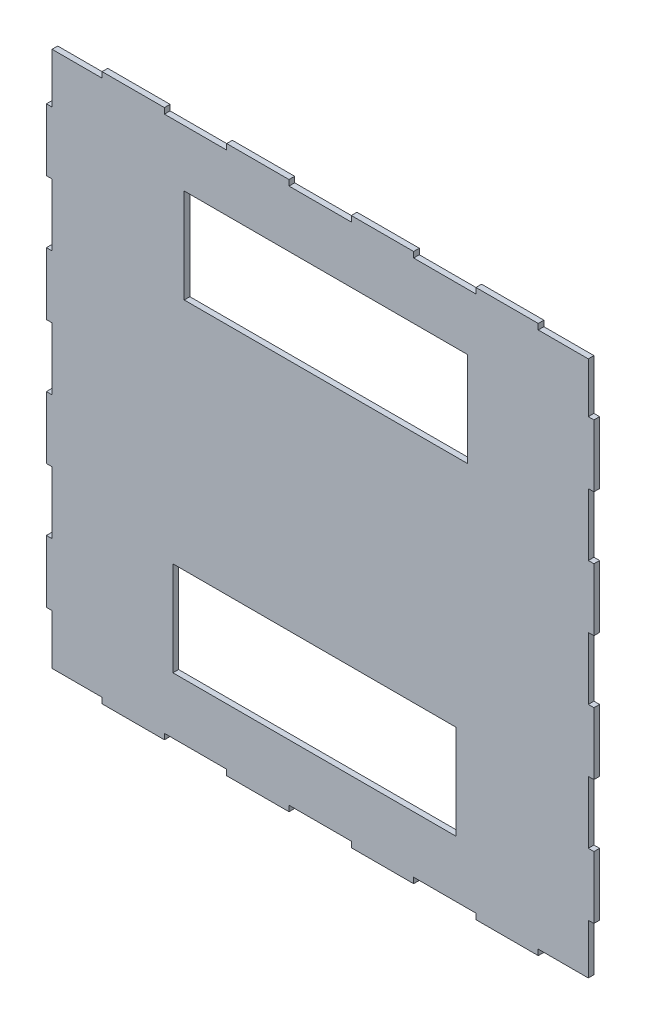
ISO-10303-21;
HEADER;
FILE_DESCRIPTION(('STEP AP214'),'2;1');
FILE_NAME('part.step','',(''),(''),'','','');
FILE_SCHEMA(('AUTOMOTIVE_DESIGN { 1 0 10303 214 1 1 1 1 }'));
ENDSEC;
DATA;
#1=APPLICATION_CONTEXT('core data for automotive mechanical design processes');
#2=APPLICATION_PROTOCOL_DEFINITION('international standard','automotive_design',2000,#1);
#3=PRODUCT_CONTEXT('',#1,'mechanical');
#4=PRODUCT('Part','Part','',(#3));
#5=PRODUCT_RELATED_PRODUCT_CATEGORY('part','',(#4));
#6=PRODUCT_DEFINITION_FORMATION('','',#4);
#7=PRODUCT_DEFINITION_CONTEXT('part definition',#1,'design');
#8=PRODUCT_DEFINITION('design','',#6,#7);
#9=PRODUCT_DEFINITION_SHAPE('','',#8);
#10=(LENGTH_UNIT() NAMED_UNIT(*) SI_UNIT(.MILLI.,.METRE.));
#11=(NAMED_UNIT(*) PLANE_ANGLE_UNIT() SI_UNIT($,.RADIAN.));
#12=(NAMED_UNIT(*) SI_UNIT($,.STERADIAN.) SOLID_ANGLE_UNIT());
#13=UNCERTAINTY_MEASURE_WITH_UNIT(LENGTH_MEASURE(1.E-05),#10,'distance_accuracy_value','');
#14=(GEOMETRIC_REPRESENTATION_CONTEXT(3) GLOBAL_UNCERTAINTY_ASSIGNED_CONTEXT((#13)) GLOBAL_UNIT_ASSIGNED_CONTEXT((#10,
#11,#12)) REPRESENTATION_CONTEXT('',''));
#15=CARTESIAN_POINT('',(0.,0.,0.));
#16=DIRECTION('',(0.,0.,1.));
#17=DIRECTION('',(1.,0.,0.));
#18=AXIS2_PLACEMENT_3D('',#15,#16,#17);
#19=CARTESIAN_POINT('',(0.,0.,3.));
#20=DIRECTION('',(0.,0.,1.));
#21=DIRECTION('',(1.,0.,0.));
#22=AXIS2_PLACEMENT_3D('',#19,#20,#21);
#23=PLANE('',#22);
#24=DIRECTION('',(1.,0.,0.));
#25=VECTOR('',#24,1.);
#26=CARTESIAN_POINT('',(-26.5,0.,3.));
#27=LINE('',#26,#25);
#28=CARTESIAN_POINT('',(-26.5,0.,3.));
#29=VERTEX_POINT('',#28);
#30=CARTESIAN_POINT('',(0.,0.,3.));
#31=VERTEX_POINT('',#30);
#32=EDGE_CURVE('E604',#29,#31,#27,.T.);
#33=ORIENTED_EDGE('',*,*,#32,.T.);
#34=DIRECTION('',(0.,1.,0.));
#35=VECTOR('',#34,1.);
#36=CARTESIAN_POINT('',(0.,0.,3.));
#37=LINE('',#36,#35);
#38=CARTESIAN_POINT('',(0.,26.5,3.));
#39=VERTEX_POINT('',#38);
#40=EDGE_CURVE('E608',#31,#39,#37,.T.);
#41=ORIENTED_EDGE('',*,*,#40,.T.);
#42=DIRECTION('',(1.,0.,0.));
#43=VECTOR('',#42,1.);
#44=CARTESIAN_POINT('',(0.,26.5,3.));
#45=LINE('',#44,#43);
#46=CARTESIAN_POINT('',(3.,26.5,3.));
#47=VERTEX_POINT('',#46);
#48=EDGE_CURVE('E612',#39,#47,#45,.T.);
#49=ORIENTED_EDGE('',*,*,#48,.T.);
#50=DIRECTION('',(0.,1.,0.));
#51=VECTOR('',#50,1.);
#52=CARTESIAN_POINT('',(3.,26.5,3.));
#53=LINE('',#52,#51);
#54=CARTESIAN_POINT('',(3.,59.5,3.));
#55=VERTEX_POINT('',#54);
#56=EDGE_CURVE('E615',#47,#55,#53,.T.);
#57=ORIENTED_EDGE('',*,*,#56,.T.);
#58=DIRECTION('',(-1.,0.,0.));
#59=VECTOR('',#58,1.);
#60=CARTESIAN_POINT('',(3.,59.5,3.));
#61=LINE('',#60,#59);
#62=CARTESIAN_POINT('',(0.,59.5,3.));
#63=VERTEX_POINT('',#62);
#64=EDGE_CURVE('E618',#55,#63,#61,.T.);
#65=ORIENTED_EDGE('',*,*,#64,.T.);
#66=DIRECTION('',(0.,1.,0.));
#67=VECTOR('',#66,1.);
#68=CARTESIAN_POINT('',(0.,59.5,3.));
#69=LINE('',#68,#67);
#70=CARTESIAN_POINT('',(0.,92.5,3.));
#71=VERTEX_POINT('',#70);
#72=EDGE_CURVE('E621',#63,#71,#69,.T.);
#73=ORIENTED_EDGE('',*,*,#72,.T.);
#74=DIRECTION('',(1.,0.,0.));
#75=VECTOR('',#74,1.);
#76=CARTESIAN_POINT('',(0.,92.5,3.));
#77=LINE('',#76,#75);
#78=CARTESIAN_POINT('',(3.,92.5,3.));
#79=VERTEX_POINT('',#78);
#80=EDGE_CURVE('E624',#71,#79,#77,.T.);
#81=ORIENTED_EDGE('',*,*,#80,.T.);
#82=DIRECTION('',(0.,1.,0.));
#83=VECTOR('',#82,1.);
#84=CARTESIAN_POINT('',(3.,92.5,3.));
#85=LINE('',#84,#83);
#86=CARTESIAN_POINT('',(3.,125.5,3.));
#87=VERTEX_POINT('',#86);
#88=EDGE_CURVE('E627',#79,#87,#85,.T.);
#89=ORIENTED_EDGE('',*,*,#88,.T.);
#90=DIRECTION('',(-1.,0.,0.));
#91=VECTOR('',#90,1.);
#92=CARTESIAN_POINT('',(3.,125.5,3.));
#93=LINE('',#92,#91);
#94=CARTESIAN_POINT('',(0.,125.5,3.));
#95=VERTEX_POINT('',#94);
#96=EDGE_CURVE('E630',#87,#95,#93,.T.);
#97=ORIENTED_EDGE('',*,*,#96,.T.);
#98=DIRECTION('',(0.,1.,0.));
#99=VECTOR('',#98,1.);
#100=CARTESIAN_POINT('',(0.,125.5,3.));
#101=LINE('',#100,#99);
#102=CARTESIAN_POINT('',(0.,158.5,3.));
#103=VERTEX_POINT('',#102);
#104=EDGE_CURVE('E633',#95,#103,#101,.T.);
#105=ORIENTED_EDGE('',*,*,#104,.T.);
#106=DIRECTION('',(1.,0.,0.));
#107=VECTOR('',#106,1.);
#108=CARTESIAN_POINT('',(0.,158.5,3.));
#109=LINE('',#108,#107);
#110=CARTESIAN_POINT('',(3.,158.5,3.));
#111=VERTEX_POINT('',#110);
#112=EDGE_CURVE('E636',#103,#111,#109,.T.);
#113=ORIENTED_EDGE('',*,*,#112,.T.);
#114=DIRECTION('',(0.,1.,0.));
#115=VECTOR('',#114,1.);
#116=CARTESIAN_POINT('',(3.,158.5,3.));
#117=LINE('',#116,#115);
#118=CARTESIAN_POINT('',(3.,191.5,3.));
#119=VERTEX_POINT('',#118);
#120=EDGE_CURVE('E639',#111,#119,#117,.T.);
#121=ORIENTED_EDGE('',*,*,#120,.T.);
#122=DIRECTION('',(-1.,0.,0.));
#123=VECTOR('',#122,1.);
#124=CARTESIAN_POINT('',(3.,191.5,3.));
#125=LINE('',#124,#123);
#126=CARTESIAN_POINT('',(0.,191.5,3.));
#127=VERTEX_POINT('',#126);
#128=EDGE_CURVE('E642',#119,#127,#125,.T.);
#129=ORIENTED_EDGE('',*,*,#128,.T.);
#130=DIRECTION('',(0.,1.,0.));
#131=VECTOR('',#130,1.);
#132=CARTESIAN_POINT('',(0.,191.5,3.));
#133=LINE('',#132,#131);
#134=CARTESIAN_POINT('',(0.,224.5,3.));
#135=VERTEX_POINT('',#134);
#136=EDGE_CURVE('E645',#127,#135,#133,.T.);
#137=ORIENTED_EDGE('',*,*,#136,.T.);
#138=DIRECTION('',(1.,0.,0.));
#139=VECTOR('',#138,1.);
#140=CARTESIAN_POINT('',(0.,224.5,3.));
#141=LINE('',#140,#139);
#142=CARTESIAN_POINT('',(3.,224.5,3.));
#143=VERTEX_POINT('',#142);
#144=EDGE_CURVE('E648',#135,#143,#141,.T.);
#145=ORIENTED_EDGE('',*,*,#144,.T.);
#146=DIRECTION('',(0.,1.,0.));
#147=VECTOR('',#146,1.);
#148=CARTESIAN_POINT('',(3.,224.5,3.));
#149=LINE('',#148,#147);
#150=CARTESIAN_POINT('',(3.,257.5,3.));
#151=VERTEX_POINT('',#150);
#152=EDGE_CURVE('E651',#143,#151,#149,.T.);
#153=ORIENTED_EDGE('',*,*,#152,.T.);
#154=DIRECTION('',(-1.,0.,0.));
#155=VECTOR('',#154,1.);
#156=CARTESIAN_POINT('',(3.,257.5,3.));
#157=LINE('',#156,#155);
#158=CARTESIAN_POINT('',(0.,257.5,3.));
#159=VERTEX_POINT('',#158);
#160=EDGE_CURVE('E654',#151,#159,#157,.T.);
#161=ORIENTED_EDGE('',*,*,#160,.T.);
#162=DIRECTION('',(0.,1.,0.));
#163=VECTOR('',#162,1.);
#164=CARTESIAN_POINT('',(0.,257.5,3.));
#165=LINE('',#164,#163);
#166=CARTESIAN_POINT('',(0.,284.,3.));
#167=VERTEX_POINT('',#166);
#168=EDGE_CURVE('E657',#159,#167,#165,.T.);
#169=ORIENTED_EDGE('',*,*,#168,.T.);
#170=DIRECTION('',(-1.,0.,0.));
#171=VECTOR('',#170,1.);
#172=CARTESIAN_POINT('',(0.,284.,3.));
#173=LINE('',#172,#171);
#174=CARTESIAN_POINT('',(-26.5,284.,3.));
#175=VERTEX_POINT('',#174);
#176=EDGE_CURVE('E660',#167,#175,#173,.T.);
#177=ORIENTED_EDGE('',*,*,#176,.T.);
#178=DIRECTION('',(0.,1.,0.));
#179=VECTOR('',#178,1.);
#180=CARTESIAN_POINT('',(-26.5,284.,3.));
#181=LINE('',#180,#179);
#182=CARTESIAN_POINT('',(-26.5,287.,3.));
#183=VERTEX_POINT('',#182);
#184=EDGE_CURVE('E663',#175,#183,#181,.T.);
#185=ORIENTED_EDGE('',*,*,#184,.T.);
#186=DIRECTION('',(-1.,0.,0.));
#187=VECTOR('',#186,1.);
#188=CARTESIAN_POINT('',(-26.5,287.,3.));
#189=LINE('',#188,#187);
#190=CARTESIAN_POINT('',(-59.5,287.,3.));
#191=VERTEX_POINT('',#190);
#192=EDGE_CURVE('E666',#183,#191,#189,.T.);
#193=ORIENTED_EDGE('',*,*,#192,.T.);
#194=DIRECTION('',(0.,-1.,0.));
#195=VECTOR('',#194,1.);
#196=CARTESIAN_POINT('',(-59.5,287.,3.));
#197=LINE('',#196,#195);
#198=CARTESIAN_POINT('',(-59.5,284.,3.));
#199=VERTEX_POINT('',#198);
#200=EDGE_CURVE('E669',#191,#199,#197,.T.);
#201=ORIENTED_EDGE('',*,*,#200,.T.);
#202=DIRECTION('',(-1.,0.,0.));
#203=VECTOR('',#202,1.);
#204=CARTESIAN_POINT('',(-59.5,284.,3.));
#205=LINE('',#204,#203);
#206=CARTESIAN_POINT('',(-92.5,284.,3.));
#207=VERTEX_POINT('',#206);
#208=EDGE_CURVE('E672',#199,#207,#205,.T.);
#209=ORIENTED_EDGE('',*,*,#208,.T.);
#210=DIRECTION('',(0.,1.,0.));
#211=VECTOR('',#210,1.);
#212=CARTESIAN_POINT('',(-92.5,284.,3.));
#213=LINE('',#212,#211);
#214=CARTESIAN_POINT('',(-92.5,287.,3.));
#215=VERTEX_POINT('',#214);
#216=EDGE_CURVE('E675',#207,#215,#213,.T.);
#217=ORIENTED_EDGE('',*,*,#216,.T.);
#218=DIRECTION('',(-1.,0.,0.));
#219=VECTOR('',#218,1.);
#220=CARTESIAN_POINT('',(-92.5,287.,3.));
#221=LINE('',#220,#219);
#222=CARTESIAN_POINT('',(-125.5,287.,3.));
#223=VERTEX_POINT('',#222);
#224=EDGE_CURVE('E678',#215,#223,#221,.T.);
#225=ORIENTED_EDGE('',*,*,#224,.T.);
#226=DIRECTION('',(0.,-1.,0.));
#227=VECTOR('',#226,1.);
#228=CARTESIAN_POINT('',(-125.5,287.,3.));
#229=LINE('',#228,#227);
#230=CARTESIAN_POINT('',(-125.5,284.,3.));
#231=VERTEX_POINT('',#230);
#232=EDGE_CURVE('E681',#223,#231,#229,.T.);
#233=ORIENTED_EDGE('',*,*,#232,.T.);
#234=DIRECTION('',(-1.,0.,0.));
#235=VECTOR('',#234,1.);
#236=CARTESIAN_POINT('',(-125.5,284.,3.));
#237=LINE('',#236,#235);
#238=CARTESIAN_POINT('',(-158.5,284.,3.));
#239=VERTEX_POINT('',#238);
#240=EDGE_CURVE('E684',#231,#239,#237,.T.);
#241=ORIENTED_EDGE('',*,*,#240,.T.);
#242=DIRECTION('',(0.,1.,0.));
#243=VECTOR('',#242,1.);
#244=CARTESIAN_POINT('',(-158.5,284.,3.));
#245=LINE('',#244,#243);
#246=CARTESIAN_POINT('',(-158.5,287.,3.));
#247=VERTEX_POINT('',#246);
#248=EDGE_CURVE('E687',#239,#247,#245,.T.);
#249=ORIENTED_EDGE('',*,*,#248,.T.);
#250=DIRECTION('',(-1.,0.,0.));
#251=VECTOR('',#250,1.);
#252=CARTESIAN_POINT('',(-158.5,287.,3.));
#253=LINE('',#252,#251);
#254=CARTESIAN_POINT('',(-191.5,287.,3.));
#255=VERTEX_POINT('',#254);
#256=EDGE_CURVE('E690',#247,#255,#253,.T.);
#257=ORIENTED_EDGE('',*,*,#256,.T.);
#258=DIRECTION('',(0.,-1.,0.));
#259=VECTOR('',#258,1.);
#260=CARTESIAN_POINT('',(-191.5,287.,3.));
#261=LINE('',#260,#259);
#262=CARTESIAN_POINT('',(-191.5,284.,3.));
#263=VERTEX_POINT('',#262);
#264=EDGE_CURVE('E693',#255,#263,#261,.T.);
#265=ORIENTED_EDGE('',*,*,#264,.T.);
#266=DIRECTION('',(-1.,0.,0.));
#267=VECTOR('',#266,1.);
#268=CARTESIAN_POINT('',(-191.5,284.,3.));
#269=LINE('',#268,#267);
#270=CARTESIAN_POINT('',(-224.5,284.,3.));
#271=VERTEX_POINT('',#270);
#272=EDGE_CURVE('E696',#263,#271,#269,.T.);
#273=ORIENTED_EDGE('',*,*,#272,.T.);
#274=DIRECTION('',(0.,1.,0.));
#275=VECTOR('',#274,1.);
#276=CARTESIAN_POINT('',(-224.5,284.,3.));
#277=LINE('',#276,#275);
#278=CARTESIAN_POINT('',(-224.5,287.,3.));
#279=VERTEX_POINT('',#278);
#280=EDGE_CURVE('E699',#271,#279,#277,.T.);
#281=ORIENTED_EDGE('',*,*,#280,.T.);
#282=DIRECTION('',(-1.,0.,0.));
#283=VECTOR('',#282,1.);
#284=CARTESIAN_POINT('',(-224.5,287.,3.));
#285=LINE('',#284,#283);
#286=CARTESIAN_POINT('',(-257.5,287.,3.));
#287=VERTEX_POINT('',#286);
#288=EDGE_CURVE('E702',#279,#287,#285,.T.);
#289=ORIENTED_EDGE('',*,*,#288,.T.);
#290=DIRECTION('',(0.,-1.,0.));
#291=VECTOR('',#290,1.);
#292=CARTESIAN_POINT('',(-257.5,287.,3.));
#293=LINE('',#292,#291);
#294=CARTESIAN_POINT('',(-257.5,284.,3.));
#295=VERTEX_POINT('',#294);
#296=EDGE_CURVE('E705',#287,#295,#293,.T.);
#297=ORIENTED_EDGE('',*,*,#296,.T.);
#298=DIRECTION('',(-1.,0.,0.));
#299=VECTOR('',#298,1.);
#300=CARTESIAN_POINT('',(-257.5,284.,3.));
#301=LINE('',#300,#299);
#302=CARTESIAN_POINT('',(-284.,284.,3.));
#303=VERTEX_POINT('',#302);
#304=EDGE_CURVE('E708',#295,#303,#301,.T.);
#305=ORIENTED_EDGE('',*,*,#304,.T.);
#306=DIRECTION('',(0.,-1.,0.));
#307=VECTOR('',#306,1.);
#308=CARTESIAN_POINT('',(-284.,284.,3.));
#309=LINE('',#308,#307);
#310=CARTESIAN_POINT('',(-284.,257.5,3.));
#311=VERTEX_POINT('',#310);
#312=EDGE_CURVE('E711',#303,#311,#309,.T.);
#313=ORIENTED_EDGE('',*,*,#312,.T.);
#314=DIRECTION('',(-1.,0.,0.));
#315=VECTOR('',#314,1.);
#316=CARTESIAN_POINT('',(-284.,257.5,3.));
#317=LINE('',#316,#315);
#318=CARTESIAN_POINT('',(-287.,257.5,3.));
#319=VERTEX_POINT('',#318);
#320=EDGE_CURVE('E714',#311,#319,#317,.T.);
#321=ORIENTED_EDGE('',*,*,#320,.T.);
#322=DIRECTION('',(0.,-1.,0.));
#323=VECTOR('',#322,1.);
#324=CARTESIAN_POINT('',(-287.,257.5,3.));
#325=LINE('',#324,#323);
#326=CARTESIAN_POINT('',(-287.,224.5,3.));
#327=VERTEX_POINT('',#326);
#328=EDGE_CURVE('E717',#319,#327,#325,.T.);
#329=ORIENTED_EDGE('',*,*,#328,.T.);
#330=DIRECTION('',(1.,0.,0.));
#331=VECTOR('',#330,1.);
#332=CARTESIAN_POINT('',(-287.,224.5,3.));
#333=LINE('',#332,#331);
#334=CARTESIAN_POINT('',(-284.,224.5,3.));
#335=VERTEX_POINT('',#334);
#336=EDGE_CURVE('E720',#327,#335,#333,.T.);
#337=ORIENTED_EDGE('',*,*,#336,.T.);
#338=DIRECTION('',(0.,-1.,0.));
#339=VECTOR('',#338,1.);
#340=CARTESIAN_POINT('',(-284.,224.5,3.));
#341=LINE('',#340,#339);
#342=CARTESIAN_POINT('',(-284.,191.5,3.));
#343=VERTEX_POINT('',#342);
#344=EDGE_CURVE('E723',#335,#343,#341,.T.);
#345=ORIENTED_EDGE('',*,*,#344,.T.);
#346=DIRECTION('',(-1.,0.,0.));
#347=VECTOR('',#346,1.);
#348=CARTESIAN_POINT('',(-284.,191.5,3.));
#349=LINE('',#348,#347);
#350=CARTESIAN_POINT('',(-287.,191.5,3.));
#351=VERTEX_POINT('',#350);
#352=EDGE_CURVE('E726',#343,#351,#349,.T.);
#353=ORIENTED_EDGE('',*,*,#352,.T.);
#354=DIRECTION('',(0.,-1.,0.));
#355=VECTOR('',#354,1.);
#356=CARTESIAN_POINT('',(-287.,191.5,3.));
#357=LINE('',#356,#355);
#358=CARTESIAN_POINT('',(-287.,158.5,3.));
#359=VERTEX_POINT('',#358);
#360=EDGE_CURVE('E729',#351,#359,#357,.T.);
#361=ORIENTED_EDGE('',*,*,#360,.T.);
#362=DIRECTION('',(1.,0.,0.));
#363=VECTOR('',#362,1.);
#364=CARTESIAN_POINT('',(-287.,158.5,3.));
#365=LINE('',#364,#363);
#366=CARTESIAN_POINT('',(-284.,158.5,3.));
#367=VERTEX_POINT('',#366);
#368=EDGE_CURVE('E732',#359,#367,#365,.T.);
#369=ORIENTED_EDGE('',*,*,#368,.T.);
#370=DIRECTION('',(0.,-1.,0.));
#371=VECTOR('',#370,1.);
#372=CARTESIAN_POINT('',(-284.,158.5,3.));
#373=LINE('',#372,#371);
#374=CARTESIAN_POINT('',(-284.,125.5,3.));
#375=VERTEX_POINT('',#374);
#376=EDGE_CURVE('E735',#367,#375,#373,.T.);
#377=ORIENTED_EDGE('',*,*,#376,.T.);
#378=DIRECTION('',(-1.,0.,0.));
#379=VECTOR('',#378,1.);
#380=CARTESIAN_POINT('',(-284.,125.5,3.));
#381=LINE('',#380,#379);
#382=CARTESIAN_POINT('',(-287.,125.5,3.));
#383=VERTEX_POINT('',#382);
#384=EDGE_CURVE('E738',#375,#383,#381,.T.);
#385=ORIENTED_EDGE('',*,*,#384,.T.);
#386=DIRECTION('',(0.,-1.,0.));
#387=VECTOR('',#386,1.);
#388=CARTESIAN_POINT('',(-287.,125.5,3.));
#389=LINE('',#388,#387);
#390=CARTESIAN_POINT('',(-287.,92.5000000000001,3.));
#391=VERTEX_POINT('',#390);
#392=EDGE_CURVE('E741',#383,#391,#389,.T.);
#393=ORIENTED_EDGE('',*,*,#392,.T.);
#394=DIRECTION('',(1.,0.,0.));
#395=VECTOR('',#394,1.);
#396=CARTESIAN_POINT('',(-287.,92.5000000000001,3.));
#397=LINE('',#396,#395);
#398=CARTESIAN_POINT('',(-284.,92.5000000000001,3.));
#399=VERTEX_POINT('',#398);
#400=EDGE_CURVE('E744',#391,#399,#397,.T.);
#401=ORIENTED_EDGE('',*,*,#400,.T.);
#402=DIRECTION('',(0.,-1.,0.));
#403=VECTOR('',#402,1.);
#404=CARTESIAN_POINT('',(-284.,92.5000000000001,3.));
#405=LINE('',#404,#403);
#406=CARTESIAN_POINT('',(-284.,59.5000000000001,3.));
#407=VERTEX_POINT('',#406);
#408=EDGE_CURVE('E747',#399,#407,#405,.T.);
#409=ORIENTED_EDGE('',*,*,#408,.T.);
#410=DIRECTION('',(-1.,0.,0.));
#411=VECTOR('',#410,1.);
#412=CARTESIAN_POINT('',(-284.,59.5000000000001,3.));
#413=LINE('',#412,#411);
#414=CARTESIAN_POINT('',(-287.,59.5000000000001,3.));
#415=VERTEX_POINT('',#414);
#416=EDGE_CURVE('E750',#407,#415,#413,.T.);
#417=ORIENTED_EDGE('',*,*,#416,.T.);
#418=DIRECTION('',(0.,-1.,0.));
#419=VECTOR('',#418,1.);
#420=CARTESIAN_POINT('',(-287.,59.5000000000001,3.));
#421=LINE('',#420,#419);
#422=CARTESIAN_POINT('',(-287.,26.5000000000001,3.));
#423=VERTEX_POINT('',#422);
#424=EDGE_CURVE('E753',#415,#423,#421,.T.);
#425=ORIENTED_EDGE('',*,*,#424,.T.);
#426=DIRECTION('',(1.,0.,0.));
#427=VECTOR('',#426,1.);
#428=CARTESIAN_POINT('',(-287.,26.5000000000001,3.));
#429=LINE('',#428,#427);
#430=CARTESIAN_POINT('',(-284.,26.5000000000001,3.));
#431=VERTEX_POINT('',#430);
#432=EDGE_CURVE('E756',#423,#431,#429,.T.);
#433=ORIENTED_EDGE('',*,*,#432,.T.);
#434=DIRECTION('',(0.,-1.,0.));
#435=VECTOR('',#434,1.);
#436=CARTESIAN_POINT('',(-284.,26.5000000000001,3.));
#437=LINE('',#436,#435);
#438=CARTESIAN_POINT('',(-284.,1.28369537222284E-13,3.));
#439=VERTEX_POINT('',#438);
#440=EDGE_CURVE('E759',#431,#439,#437,.T.);
#441=ORIENTED_EDGE('',*,*,#440,.T.);
#442=DIRECTION('',(1.,0.,0.));
#443=VECTOR('',#442,1.);
#444=CARTESIAN_POINT('',(-284.,1.28369537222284E-13,3.));
#445=LINE('',#444,#443);
#446=CARTESIAN_POINT('',(-257.5,1.28369537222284E-13,3.));
#447=VERTEX_POINT('',#446);
#448=EDGE_CURVE('E762',#439,#447,#445,.T.);
#449=ORIENTED_EDGE('',*,*,#448,.T.);
#450=DIRECTION('',(0.,-1.,0.));
#451=VECTOR('',#450,1.);
#452=CARTESIAN_POINT('',(-257.5,1.28369537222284E-13,3.));
#453=LINE('',#452,#451);
#454=CARTESIAN_POINT('',(-257.5,-3.,3.));
#455=VERTEX_POINT('',#454);
#456=EDGE_CURVE('E765',#447,#455,#453,.T.);
#457=ORIENTED_EDGE('',*,*,#456,.T.);
#458=DIRECTION('',(1.,0.,0.));
#459=VECTOR('',#458,1.);
#460=CARTESIAN_POINT('',(-257.5,-3.,3.));
#461=LINE('',#460,#459);
#462=CARTESIAN_POINT('',(-224.5,-3.,3.));
#463=VERTEX_POINT('',#462);
#464=EDGE_CURVE('E768',#455,#463,#461,.T.);
#465=ORIENTED_EDGE('',*,*,#464,.T.);
#466=DIRECTION('',(0.,1.,0.));
#467=VECTOR('',#466,1.);
#468=CARTESIAN_POINT('',(-224.5,-3.,3.));
#469=LINE('',#468,#467);
#470=CARTESIAN_POINT('',(-224.5,0.,3.));
#471=VERTEX_POINT('',#470);
#472=EDGE_CURVE('E771',#463,#471,#469,.T.);
#473=ORIENTED_EDGE('',*,*,#472,.T.);
#474=DIRECTION('',(1.,0.,0.));
#475=VECTOR('',#474,1.);
#476=CARTESIAN_POINT('',(-224.5,0.,3.));
#477=LINE('',#476,#475);
#478=CARTESIAN_POINT('',(-191.5,0.,3.));
#479=VERTEX_POINT('',#478);
#480=EDGE_CURVE('E774',#471,#479,#477,.T.);
#481=ORIENTED_EDGE('',*,*,#480,.T.);
#482=DIRECTION('',(0.,-1.,0.));
#483=VECTOR('',#482,1.);
#484=CARTESIAN_POINT('',(-191.5,0.,3.));
#485=LINE('',#484,#483);
#486=CARTESIAN_POINT('',(-191.5,-3.,3.));
#487=VERTEX_POINT('',#486);
#488=EDGE_CURVE('E777',#479,#487,#485,.T.);
#489=ORIENTED_EDGE('',*,*,#488,.T.);
#490=DIRECTION('',(1.,0.,0.));
#491=VECTOR('',#490,1.);
#492=CARTESIAN_POINT('',(-191.5,-3.,3.));
#493=LINE('',#492,#491);
#494=CARTESIAN_POINT('',(-158.5,-3.,3.));
#495=VERTEX_POINT('',#494);
#496=EDGE_CURVE('E780',#487,#495,#493,.T.);
#497=ORIENTED_EDGE('',*,*,#496,.T.);
#498=DIRECTION('',(0.,1.,0.));
#499=VECTOR('',#498,1.);
#500=CARTESIAN_POINT('',(-158.5,-3.,3.));
#501=LINE('',#500,#499);
#502=CARTESIAN_POINT('',(-158.5,0.,3.));
#503=VERTEX_POINT('',#502);
#504=EDGE_CURVE('E783',#495,#503,#501,.T.);
#505=ORIENTED_EDGE('',*,*,#504,.T.);
#506=DIRECTION('',(1.,0.,0.));
#507=VECTOR('',#506,1.);
#508=CARTESIAN_POINT('',(-158.5,0.,3.));
#509=LINE('',#508,#507);
#510=CARTESIAN_POINT('',(-125.5,0.,3.));
#511=VERTEX_POINT('',#510);
#512=EDGE_CURVE('E786',#503,#511,#509,.T.);
#513=ORIENTED_EDGE('',*,*,#512,.T.);
#514=DIRECTION('',(0.,-1.,0.));
#515=VECTOR('',#514,1.);
#516=CARTESIAN_POINT('',(-125.5,0.,3.));
#517=LINE('',#516,#515);
#518=CARTESIAN_POINT('',(-125.5,-3.,3.));
#519=VERTEX_POINT('',#518);
#520=EDGE_CURVE('E789',#511,#519,#517,.T.);
#521=ORIENTED_EDGE('',*,*,#520,.T.);
#522=DIRECTION('',(1.,0.,0.));
#523=VECTOR('',#522,1.);
#524=CARTESIAN_POINT('',(-125.5,-3.,3.));
#525=LINE('',#524,#523);
#526=CARTESIAN_POINT('',(-92.5,-3.,3.));
#527=VERTEX_POINT('',#526);
#528=EDGE_CURVE('E792',#519,#527,#525,.T.);
#529=ORIENTED_EDGE('',*,*,#528,.T.);
#530=DIRECTION('',(0.,1.,0.));
#531=VECTOR('',#530,1.);
#532=CARTESIAN_POINT('',(-92.5,-3.,3.));
#533=LINE('',#532,#531);
#534=CARTESIAN_POINT('',(-92.5,0.,3.));
#535=VERTEX_POINT('',#534);
#536=EDGE_CURVE('E795',#527,#535,#533,.T.);
#537=ORIENTED_EDGE('',*,*,#536,.T.);
#538=DIRECTION('',(1.,0.,0.));
#539=VECTOR('',#538,1.);
#540=CARTESIAN_POINT('',(-92.5,0.,3.));
#541=LINE('',#540,#539);
#542=CARTESIAN_POINT('',(-59.5,0.,3.));
#543=VERTEX_POINT('',#542);
#544=EDGE_CURVE('E798',#535,#543,#541,.T.);
#545=ORIENTED_EDGE('',*,*,#544,.T.);
#546=DIRECTION('',(0.,-1.,0.));
#547=VECTOR('',#546,1.);
#548=CARTESIAN_POINT('',(-59.5,0.,3.));
#549=LINE('',#548,#547);
#550=CARTESIAN_POINT('',(-59.5,-3.,3.));
#551=VERTEX_POINT('',#550);
#552=EDGE_CURVE('E801',#543,#551,#549,.T.);
#553=ORIENTED_EDGE('',*,*,#552,.T.);
#554=DIRECTION('',(1.,0.,0.));
#555=VECTOR('',#554,1.);
#556=CARTESIAN_POINT('',(-59.5,-3.,3.));
#557=LINE('',#556,#555);
#558=CARTESIAN_POINT('',(-26.5,-3.,3.));
#559=VERTEX_POINT('',#558);
#560=EDGE_CURVE('E804',#551,#559,#557,.T.);
#561=ORIENTED_EDGE('',*,*,#560,.T.);
#562=DIRECTION('',(0.,1.,0.));
#563=VECTOR('',#562,1.);
#564=CARTESIAN_POINT('',(-26.5,-3.,3.));
#565=LINE('',#564,#563);
#566=EDGE_CURVE('E807',#559,#29,#565,.T.);
#567=ORIENTED_EDGE('',*,*,#566,.T.);
#568=EDGE_LOOP('',(#33,#41,#49,#57,#65,#73,#81,#89,#97,#105,#113,#121,#129,#137,#145,#153,#161,
#169,#177,#185,#193,#201,#209,#217,#225,#233,#241,#249,#257,#265,#273,#281,#289,#297,#305,#313,
#321,#329,#337,#345,#353,#361,#369,#377,#385,#393,#401,#409,#417,#425,#433,#441,#449,#457,#465,
#473,#481,#489,#497,#505,#513,#521,#529,#537,#545,#553,#561,#567));
#569=FACE_BOUND('',#568,.T.);
#570=DIRECTION('',(1.,0.,0.));
#571=VECTOR('',#570,1.);
#572=CARTESIAN_POINT('',(-214.,204.,3.));
#573=LINE('',#572,#571);
#574=CARTESIAN_POINT('',(-214.,204.,3.));
#575=VERTEX_POINT('',#574);
#576=CARTESIAN_POINT('',(-64.,204.,3.));
#577=VERTEX_POINT('',#576);
#578=EDGE_CURVE('E564',#575,#577,#573,.T.);
#579=ORIENTED_EDGE('',*,*,#578,.F.);
#580=DIRECTION('',(0.,-1.,0.));
#581=VECTOR('',#580,1.);
#582=CARTESIAN_POINT('',(-214.,254.,3.));
#583=LINE('',#582,#581);
#584=CARTESIAN_POINT('',(-214.,254.,3.));
#585=VERTEX_POINT('',#584);
#586=EDGE_CURVE('E561',#585,#575,#583,.T.);
#587=ORIENTED_EDGE('',*,*,#586,.F.);
#588=DIRECTION('',(-1.,0.,0.));
#589=VECTOR('',#588,1.);
#590=CARTESIAN_POINT('',(-214.,254.,3.));
#591=LINE('',#590,#589);
#592=CARTESIAN_POINT('',(-64.,254.,3.));
#593=VERTEX_POINT('',#592);
#594=EDGE_CURVE('E572',#593,#585,#591,.T.);
#595=ORIENTED_EDGE('',*,*,#594,.F.);
#596=DIRECTION('',(0.,1.,0.));
#597=VECTOR('',#596,1.);
#598=CARTESIAN_POINT('',(-64.,254.,3.));
#599=LINE('',#598,#597);
#600=EDGE_CURVE('E568',#577,#593,#599,.T.);
#601=ORIENTED_EDGE('',*,*,#600,.F.);
#602=EDGE_LOOP('',(#579,#587,#595,#601));
#603=FACE_BOUND('',#602,.T.);
#604=DIRECTION('',(1.,0.,0.));
#605=VECTOR('',#604,1.);
#606=CARTESIAN_POINT('',(-220.,30.,3.));
#607=LINE('',#606,#605);
#608=CARTESIAN_POINT('',(-220.,30.,3.));
#609=VERTEX_POINT('',#608);
#610=CARTESIAN_POINT('',(-70.,30.,3.));
#611=VERTEX_POINT('',#610);
#612=EDGE_CURVE('E522',#609,#611,#607,.T.);
#613=ORIENTED_EDGE('',*,*,#612,.F.);
#614=DIRECTION('',(0.,-1.,0.));
#615=VECTOR('',#614,1.);
#616=CARTESIAN_POINT('',(-220.,80.,3.));
#617=LINE('',#616,#615);
#618=CARTESIAN_POINT('',(-220.,80.,3.));
#619=VERTEX_POINT('',#618);
#620=EDGE_CURVE('E513',#619,#609,#617,.T.);
#621=ORIENTED_EDGE('',*,*,#620,.F.);
#622=DIRECTION('',(-1.,0.,0.));
#623=VECTOR('',#622,1.);
#624=CARTESIAN_POINT('',(-220.,80.,3.));
#625=LINE('',#624,#623);
#626=CARTESIAN_POINT('',(-70.,80.,3.));
#627=VERTEX_POINT('',#626);
#628=EDGE_CURVE('E539',#627,#619,#625,.T.);
#629=ORIENTED_EDGE('',*,*,#628,.F.);
#630=DIRECTION('',(0.,1.,0.));
#631=VECTOR('',#630,1.);
#632=CARTESIAN_POINT('',(-70.,80.,3.));
#633=LINE('',#632,#631);
#634=EDGE_CURVE('E535',#611,#627,#633,.T.);
#635=ORIENTED_EDGE('',*,*,#634,.F.);
#636=EDGE_LOOP('',(#613,#621,#629,#635));
#637=FACE_BOUND('',#636,.T.);
#638=ADVANCED_FACE('F39',(#569,#603,#637),#23,.T.);
#639=CARTESIAN_POINT('',(0.,0.,0.));
#640=DIRECTION('',(0.,0.,1.));
#641=DIRECTION('',(1.,0.,0.));
#642=AXIS2_PLACEMENT_3D('',#639,#640,#641);
#643=PLANE('',#642);
#644=DIRECTION('',(0.,-1.,0.));
#645=VECTOR('',#644,1.);
#646=CARTESIAN_POINT('',(-214.,254.,0.));
#647=LINE('',#646,#645);
#648=CARTESIAN_POINT('',(-214.,254.,0.));
#649=VERTEX_POINT('',#648);
#650=CARTESIAN_POINT('',(-214.,204.,0.));
#651=VERTEX_POINT('',#650);
#652=EDGE_CURVE('E531',#649,#651,#647,.T.);
#653=ORIENTED_EDGE('',*,*,#652,.T.);
#654=DIRECTION('',(1.,0.,0.));
#655=VECTOR('',#654,1.);
#656=CARTESIAN_POINT('',(-214.,204.,0.));
#657=LINE('',#656,#655);
#658=CARTESIAN_POINT('',(-64.,204.,0.));
#659=VERTEX_POINT('',#658);
#660=EDGE_CURVE('E579',#651,#659,#657,.T.);
#661=ORIENTED_EDGE('',*,*,#660,.T.);
#662=DIRECTION('',(0.,1.,0.));
#663=VECTOR('',#662,1.);
#664=CARTESIAN_POINT('',(-64.,254.,0.));
#665=LINE('',#664,#663);
#666=CARTESIAN_POINT('',(-64.,254.,0.));
#667=VERTEX_POINT('',#666);
#668=EDGE_CURVE('E583',#659,#667,#665,.T.);
#669=ORIENTED_EDGE('',*,*,#668,.T.);
#670=DIRECTION('',(-1.,0.,0.));
#671=VECTOR('',#670,1.);
#672=CARTESIAN_POINT('',(-214.,254.,0.));
#673=LINE('',#672,#671);
#674=EDGE_CURVE('E565',#667,#649,#673,.T.);
#675=ORIENTED_EDGE('',*,*,#674,.T.);
#676=EDGE_LOOP('',(#653,#661,#669,#675));
#677=FACE_BOUND('',#676,.T.);
#678=DIRECTION('',(1.,0.,0.));
#679=VECTOR('',#678,1.);
#680=CARTESIAN_POINT('',(-26.5,0.,0.));
#681=LINE('',#680,#679);
#682=CARTESIAN_POINT('',(-26.5,0.,0.));
#683=VERTEX_POINT('',#682);
#684=CARTESIAN_POINT('',(0.,0.,0.));
#685=VERTEX_POINT('',#684);
#686=EDGE_CURVE('E603',#683,#685,#681,.T.);
#687=ORIENTED_EDGE('',*,*,#686,.F.);
#688=DIRECTION('',(0.,1.,0.));
#689=VECTOR('',#688,1.);
#690=CARTESIAN_POINT('',(-26.5,-3.,0.));
#691=LINE('',#690,#689);
#692=CARTESIAN_POINT('',(-26.5,-3.,0.));
#693=VERTEX_POINT('',#692);
#694=EDGE_CURVE('E609',#693,#683,#691,.T.);
#695=ORIENTED_EDGE('',*,*,#694,.F.);
#696=DIRECTION('',(1.,0.,0.));
#697=VECTOR('',#696,1.);
#698=CARTESIAN_POINT('',(-59.5,-3.,0.));
#699=LINE('',#698,#697);
#700=CARTESIAN_POINT('',(-59.5,-3.,0.));
#701=VERTEX_POINT('',#700);
#702=EDGE_CURVE('E1009',#701,#693,#699,.T.);
#703=ORIENTED_EDGE('',*,*,#702,.F.);
#704=DIRECTION('',(0.,-1.,0.));
#705=VECTOR('',#704,1.);
#706=CARTESIAN_POINT('',(-59.5,0.,0.));
#707=LINE('',#706,#705);
#708=CARTESIAN_POINT('',(-59.5,0.,0.));
#709=VERTEX_POINT('',#708);
#710=EDGE_CURVE('E1006',#709,#701,#707,.T.);
#711=ORIENTED_EDGE('',*,*,#710,.F.);
#712=DIRECTION('',(1.,0.,0.));
#713=VECTOR('',#712,1.);
#714=CARTESIAN_POINT('',(-92.5,0.,0.));
#715=LINE('',#714,#713);
#716=CARTESIAN_POINT('',(-92.5,0.,0.));
#717=VERTEX_POINT('',#716);
#718=EDGE_CURVE('E1003',#717,#709,#715,.T.);
#719=ORIENTED_EDGE('',*,*,#718,.F.);
#720=DIRECTION('',(0.,1.,0.));
#721=VECTOR('',#720,1.);
#722=CARTESIAN_POINT('',(-92.5,-3.,0.));
#723=LINE('',#722,#721);
#724=CARTESIAN_POINT('',(-92.5,-3.,0.));
#725=VERTEX_POINT('',#724);
#726=EDGE_CURVE('E1000',#725,#717,#723,.T.);
#727=ORIENTED_EDGE('',*,*,#726,.F.);
#728=DIRECTION('',(1.,0.,0.));
#729=VECTOR('',#728,1.);
#730=CARTESIAN_POINT('',(-125.5,-3.,0.));
#731=LINE('',#730,#729);
#732=CARTESIAN_POINT('',(-125.5,-3.,0.));
#733=VERTEX_POINT('',#732);
#734=EDGE_CURVE('E997',#733,#725,#731,.T.);
#735=ORIENTED_EDGE('',*,*,#734,.F.);
#736=DIRECTION('',(0.,-1.,0.));
#737=VECTOR('',#736,1.);
#738=CARTESIAN_POINT('',(-125.5,0.,0.));
#739=LINE('',#738,#737);
#740=CARTESIAN_POINT('',(-125.5,0.,0.));
#741=VERTEX_POINT('',#740);
#742=EDGE_CURVE('E994',#741,#733,#739,.T.);
#743=ORIENTED_EDGE('',*,*,#742,.F.);
#744=DIRECTION('',(1.,0.,0.));
#745=VECTOR('',#744,1.);
#746=CARTESIAN_POINT('',(-158.5,0.,0.));
#747=LINE('',#746,#745);
#748=CARTESIAN_POINT('',(-158.5,0.,0.));
#749=VERTEX_POINT('',#748);
#750=EDGE_CURVE('E991',#749,#741,#747,.T.);
#751=ORIENTED_EDGE('',*,*,#750,.F.);
#752=DIRECTION('',(0.,1.,0.));
#753=VECTOR('',#752,1.);
#754=CARTESIAN_POINT('',(-158.5,-3.,0.));
#755=LINE('',#754,#753);
#756=CARTESIAN_POINT('',(-158.5,-3.,0.));
#757=VERTEX_POINT('',#756);
#758=EDGE_CURVE('E988',#757,#749,#755,.T.);
#759=ORIENTED_EDGE('',*,*,#758,.F.);
#760=DIRECTION('',(1.,0.,0.));
#761=VECTOR('',#760,1.);
#762=CARTESIAN_POINT('',(-191.5,-3.,0.));
#763=LINE('',#762,#761);
#764=CARTESIAN_POINT('',(-191.5,-3.,0.));
#765=VERTEX_POINT('',#764);
#766=EDGE_CURVE('E985',#765,#757,#763,.T.);
#767=ORIENTED_EDGE('',*,*,#766,.F.);
#768=DIRECTION('',(0.,-1.,0.));
#769=VECTOR('',#768,1.);
#770=CARTESIAN_POINT('',(-191.5,0.,0.));
#771=LINE('',#770,#769);
#772=CARTESIAN_POINT('',(-191.5,0.,0.));
#773=VERTEX_POINT('',#772);
#774=EDGE_CURVE('E982',#773,#765,#771,.T.);
#775=ORIENTED_EDGE('',*,*,#774,.F.);
#776=DIRECTION('',(1.,0.,0.));
#777=VECTOR('',#776,1.);
#778=CARTESIAN_POINT('',(-224.5,0.,0.));
#779=LINE('',#778,#777);
#780=CARTESIAN_POINT('',(-224.5,0.,0.));
#781=VERTEX_POINT('',#780);
#782=EDGE_CURVE('E979',#781,#773,#779,.T.);
#783=ORIENTED_EDGE('',*,*,#782,.F.);
#784=DIRECTION('',(0.,1.,0.));
#785=VECTOR('',#784,1.);
#786=CARTESIAN_POINT('',(-224.5,-3.,0.));
#787=LINE('',#786,#785);
#788=CARTESIAN_POINT('',(-224.5,-3.,0.));
#789=VERTEX_POINT('',#788);
#790=EDGE_CURVE('E976',#789,#781,#787,.T.);
#791=ORIENTED_EDGE('',*,*,#790,.F.);
#792=DIRECTION('',(1.,0.,0.));
#793=VECTOR('',#792,1.);
#794=CARTESIAN_POINT('',(-257.5,-3.,0.));
#795=LINE('',#794,#793);
#796=CARTESIAN_POINT('',(-257.5,-3.,0.));
#797=VERTEX_POINT('',#796);
#798=EDGE_CURVE('E973',#797,#789,#795,.T.);
#799=ORIENTED_EDGE('',*,*,#798,.F.);
#800=DIRECTION('',(0.,-1.,0.));
#801=VECTOR('',#800,1.);
#802=CARTESIAN_POINT('',(-257.5,1.28369537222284E-13,0.));
#803=LINE('',#802,#801);
#804=CARTESIAN_POINT('',(-257.5,1.28369537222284E-13,0.));
#805=VERTEX_POINT('',#804);
#806=EDGE_CURVE('E970',#805,#797,#803,.T.);
#807=ORIENTED_EDGE('',*,*,#806,.F.);
#808=DIRECTION('',(1.,0.,0.));
#809=VECTOR('',#808,1.);
#810=CARTESIAN_POINT('',(-284.,1.28369537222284E-13,0.));
#811=LINE('',#810,#809);
#812=CARTESIAN_POINT('',(-284.,1.28369537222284E-13,0.));
#813=VERTEX_POINT('',#812);
#814=EDGE_CURVE('E967',#813,#805,#811,.T.);
#815=ORIENTED_EDGE('',*,*,#814,.F.);
#816=DIRECTION('',(0.,-1.,0.));
#817=VECTOR('',#816,1.);
#818=CARTESIAN_POINT('',(-284.,26.5000000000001,0.));
#819=LINE('',#818,#817);
#820=CARTESIAN_POINT('',(-284.,26.5000000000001,0.));
#821=VERTEX_POINT('',#820);
#822=EDGE_CURVE('E964',#821,#813,#819,.T.);
#823=ORIENTED_EDGE('',*,*,#822,.F.);
#824=DIRECTION('',(1.,0.,0.));
#825=VECTOR('',#824,1.);
#826=CARTESIAN_POINT('',(-287.,26.5000000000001,0.));
#827=LINE('',#826,#825);
#828=CARTESIAN_POINT('',(-287.,26.5000000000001,0.));
#829=VERTEX_POINT('',#828);
#830=EDGE_CURVE('E961',#829,#821,#827,.T.);
#831=ORIENTED_EDGE('',*,*,#830,.F.);
#832=DIRECTION('',(0.,-1.,0.));
#833=VECTOR('',#832,1.);
#834=CARTESIAN_POINT('',(-287.,59.5000000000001,0.));
#835=LINE('',#834,#833);
#836=CARTESIAN_POINT('',(-287.,59.5000000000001,0.));
#837=VERTEX_POINT('',#836);
#838=EDGE_CURVE('E958',#837,#829,#835,.T.);
#839=ORIENTED_EDGE('',*,*,#838,.F.);
#840=DIRECTION('',(-1.,0.,0.));
#841=VECTOR('',#840,1.);
#842=CARTESIAN_POINT('',(-284.,59.5000000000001,0.));
#843=LINE('',#842,#841);
#844=CARTESIAN_POINT('',(-284.,59.5000000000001,0.));
#845=VERTEX_POINT('',#844);
#846=EDGE_CURVE('E955',#845,#837,#843,.T.);
#847=ORIENTED_EDGE('',*,*,#846,.F.);
#848=DIRECTION('',(0.,-1.,0.));
#849=VECTOR('',#848,1.);
#850=CARTESIAN_POINT('',(-284.,92.5000000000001,0.));
#851=LINE('',#850,#849);
#852=CARTESIAN_POINT('',(-284.,92.5000000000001,0.));
#853=VERTEX_POINT('',#852);
#854=EDGE_CURVE('E952',#853,#845,#851,.T.);
#855=ORIENTED_EDGE('',*,*,#854,.F.);
#856=DIRECTION('',(1.,0.,0.));
#857=VECTOR('',#856,1.);
#858=CARTESIAN_POINT('',(-287.,92.5000000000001,0.));
#859=LINE('',#858,#857);
#860=CARTESIAN_POINT('',(-287.,92.5000000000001,0.));
#861=VERTEX_POINT('',#860);
#862=EDGE_CURVE('E949',#861,#853,#859,.T.);
#863=ORIENTED_EDGE('',*,*,#862,.F.);
#864=DIRECTION('',(0.,-1.,0.));
#865=VECTOR('',#864,1.);
#866=CARTESIAN_POINT('',(-287.,125.5,0.));
#867=LINE('',#866,#865);
#868=CARTESIAN_POINT('',(-287.,125.5,0.));
#869=VERTEX_POINT('',#868);
#870=EDGE_CURVE('E946',#869,#861,#867,.T.);
#871=ORIENTED_EDGE('',*,*,#870,.F.);
#872=DIRECTION('',(-1.,0.,0.));
#873=VECTOR('',#872,1.);
#874=CARTESIAN_POINT('',(-284.,125.5,0.));
#875=LINE('',#874,#873);
#876=CARTESIAN_POINT('',(-284.,125.5,0.));
#877=VERTEX_POINT('',#876);
#878=EDGE_CURVE('E943',#877,#869,#875,.T.);
#879=ORIENTED_EDGE('',*,*,#878,.F.);
#880=DIRECTION('',(0.,-1.,0.));
#881=VECTOR('',#880,1.);
#882=CARTESIAN_POINT('',(-284.,158.5,0.));
#883=LINE('',#882,#881);
#884=CARTESIAN_POINT('',(-284.,158.5,0.));
#885=VERTEX_POINT('',#884);
#886=EDGE_CURVE('E940',#885,#877,#883,.T.);
#887=ORIENTED_EDGE('',*,*,#886,.F.);
#888=DIRECTION('',(1.,0.,0.));
#889=VECTOR('',#888,1.);
#890=CARTESIAN_POINT('',(-287.,158.5,0.));
#891=LINE('',#890,#889);
#892=CARTESIAN_POINT('',(-287.,158.5,0.));
#893=VERTEX_POINT('',#892);
#894=EDGE_CURVE('E937',#893,#885,#891,.T.);
#895=ORIENTED_EDGE('',*,*,#894,.F.);
#896=DIRECTION('',(0.,-1.,0.));
#897=VECTOR('',#896,1.);
#898=CARTESIAN_POINT('',(-287.,191.5,0.));
#899=LINE('',#898,#897);
#900=CARTESIAN_POINT('',(-287.,191.5,0.));
#901=VERTEX_POINT('',#900);
#902=EDGE_CURVE('E934',#901,#893,#899,.T.);
#903=ORIENTED_EDGE('',*,*,#902,.F.);
#904=DIRECTION('',(-1.,0.,0.));
#905=VECTOR('',#904,1.);
#906=CARTESIAN_POINT('',(-284.,191.5,0.));
#907=LINE('',#906,#905);
#908=CARTESIAN_POINT('',(-284.,191.5,0.));
#909=VERTEX_POINT('',#908);
#910=EDGE_CURVE('E931',#909,#901,#907,.T.);
#911=ORIENTED_EDGE('',*,*,#910,.F.);
#912=DIRECTION('',(0.,-1.,0.));
#913=VECTOR('',#912,1.);
#914=CARTESIAN_POINT('',(-284.,224.5,0.));
#915=LINE('',#914,#913);
#916=CARTESIAN_POINT('',(-284.,224.5,0.));
#917=VERTEX_POINT('',#916);
#918=EDGE_CURVE('E928',#917,#909,#915,.T.);
#919=ORIENTED_EDGE('',*,*,#918,.F.);
#920=DIRECTION('',(1.,0.,0.));
#921=VECTOR('',#920,1.);
#922=CARTESIAN_POINT('',(-287.,224.5,0.));
#923=LINE('',#922,#921);
#924=CARTESIAN_POINT('',(-287.,224.5,0.));
#925=VERTEX_POINT('',#924);
#926=EDGE_CURVE('E925',#925,#917,#923,.T.);
#927=ORIENTED_EDGE('',*,*,#926,.F.);
#928=DIRECTION('',(0.,-1.,0.));
#929=VECTOR('',#928,1.);
#930=CARTESIAN_POINT('',(-287.,257.5,0.));
#931=LINE('',#930,#929);
#932=CARTESIAN_POINT('',(-287.,257.5,0.));
#933=VERTEX_POINT('',#932);
#934=EDGE_CURVE('E922',#933,#925,#931,.T.);
#935=ORIENTED_EDGE('',*,*,#934,.F.);
#936=DIRECTION('',(-1.,0.,0.));
#937=VECTOR('',#936,1.);
#938=CARTESIAN_POINT('',(-284.,257.5,0.));
#939=LINE('',#938,#937);
#940=CARTESIAN_POINT('',(-284.,257.5,0.));
#941=VERTEX_POINT('',#940);
#942=EDGE_CURVE('E919',#941,#933,#939,.T.);
#943=ORIENTED_EDGE('',*,*,#942,.F.);
#944=DIRECTION('',(0.,-1.,0.));
#945=VECTOR('',#944,1.);
#946=CARTESIAN_POINT('',(-284.,284.,0.));
#947=LINE('',#946,#945);
#948=CARTESIAN_POINT('',(-284.,284.,0.));
#949=VERTEX_POINT('',#948);
#950=EDGE_CURVE('E916',#949,#941,#947,.T.);
#951=ORIENTED_EDGE('',*,*,#950,.F.);
#952=DIRECTION('',(-1.,0.,0.));
#953=VECTOR('',#952,1.);
#954=CARTESIAN_POINT('',(-257.5,284.,0.));
#955=LINE('',#954,#953);
#956=CARTESIAN_POINT('',(-257.5,284.,0.));
#957=VERTEX_POINT('',#956);
#958=EDGE_CURVE('E913',#957,#949,#955,.T.);
#959=ORIENTED_EDGE('',*,*,#958,.F.);
#960=DIRECTION('',(0.,-1.,0.));
#961=VECTOR('',#960,1.);
#962=CARTESIAN_POINT('',(-257.5,287.,0.));
#963=LINE('',#962,#961);
#964=CARTESIAN_POINT('',(-257.5,287.,0.));
#965=VERTEX_POINT('',#964);
#966=EDGE_CURVE('E910',#965,#957,#963,.T.);
#967=ORIENTED_EDGE('',*,*,#966,.F.);
#968=DIRECTION('',(-1.,0.,0.));
#969=VECTOR('',#968,1.);
#970=CARTESIAN_POINT('',(-224.5,287.,0.));
#971=LINE('',#970,#969);
#972=CARTESIAN_POINT('',(-224.5,287.,0.));
#973=VERTEX_POINT('',#972);
#974=EDGE_CURVE('E907',#973,#965,#971,.T.);
#975=ORIENTED_EDGE('',*,*,#974,.F.);
#976=DIRECTION('',(0.,1.,0.));
#977=VECTOR('',#976,1.);
#978=CARTESIAN_POINT('',(-224.5,284.,0.));
#979=LINE('',#978,#977);
#980=CARTESIAN_POINT('',(-224.5,284.,0.));
#981=VERTEX_POINT('',#980);
#982=EDGE_CURVE('E904',#981,#973,#979,.T.);
#983=ORIENTED_EDGE('',*,*,#982,.F.);
#984=DIRECTION('',(-1.,0.,0.));
#985=VECTOR('',#984,1.);
#986=CARTESIAN_POINT('',(-191.5,284.,0.));
#987=LINE('',#986,#985);
#988=CARTESIAN_POINT('',(-191.5,284.,0.));
#989=VERTEX_POINT('',#988);
#990=EDGE_CURVE('E901',#989,#981,#987,.T.);
#991=ORIENTED_EDGE('',*,*,#990,.F.);
#992=DIRECTION('',(0.,-1.,0.));
#993=VECTOR('',#992,1.);
#994=CARTESIAN_POINT('',(-191.5,287.,0.));
#995=LINE('',#994,#993);
#996=CARTESIAN_POINT('',(-191.5,287.,0.));
#997=VERTEX_POINT('',#996);
#998=EDGE_CURVE('E898',#997,#989,#995,.T.);
#999=ORIENTED_EDGE('',*,*,#998,.F.);
#1000=DIRECTION('',(-1.,0.,0.));
#1001=VECTOR('',#1000,1.);
#1002=CARTESIAN_POINT('',(-158.5,287.,0.));
#1003=LINE('',#1002,#1001);
#1004=CARTESIAN_POINT('',(-158.5,287.,0.));
#1005=VERTEX_POINT('',#1004);
#1006=EDGE_CURVE('E895',#1005,#997,#1003,.T.);
#1007=ORIENTED_EDGE('',*,*,#1006,.F.);
#1008=DIRECTION('',(0.,1.,0.));
#1009=VECTOR('',#1008,1.);
#1010=CARTESIAN_POINT('',(-158.5,284.,0.));
#1011=LINE('',#1010,#1009);
#1012=CARTESIAN_POINT('',(-158.5,284.,0.));
#1013=VERTEX_POINT('',#1012);
#1014=EDGE_CURVE('E892',#1013,#1005,#1011,.T.);
#1015=ORIENTED_EDGE('',*,*,#1014,.F.);
#1016=DIRECTION('',(-1.,0.,0.));
#1017=VECTOR('',#1016,1.);
#1018=CARTESIAN_POINT('',(-125.5,284.,0.));
#1019=LINE('',#1018,#1017);
#1020=CARTESIAN_POINT('',(-125.5,284.,0.));
#1021=VERTEX_POINT('',#1020);
#1022=EDGE_CURVE('E889',#1021,#1013,#1019,.T.);
#1023=ORIENTED_EDGE('',*,*,#1022,.F.);
#1024=DIRECTION('',(0.,-1.,0.));
#1025=VECTOR('',#1024,1.);
#1026=CARTESIAN_POINT('',(-125.5,287.,0.));
#1027=LINE('',#1026,#1025);
#1028=CARTESIAN_POINT('',(-125.5,287.,0.));
#1029=VERTEX_POINT('',#1028);
#1030=EDGE_CURVE('E886',#1029,#1021,#1027,.T.);
#1031=ORIENTED_EDGE('',*,*,#1030,.F.);
#1032=DIRECTION('',(-1.,0.,0.));
#1033=VECTOR('',#1032,1.);
#1034=CARTESIAN_POINT('',(-92.5,287.,0.));
#1035=LINE('',#1034,#1033);
#1036=CARTESIAN_POINT('',(-92.5,287.,0.));
#1037=VERTEX_POINT('',#1036);
#1038=EDGE_CURVE('E883',#1037,#1029,#1035,.T.);
#1039=ORIENTED_EDGE('',*,*,#1038,.F.);
#1040=DIRECTION('',(0.,1.,0.));
#1041=VECTOR('',#1040,1.);
#1042=CARTESIAN_POINT('',(-92.5,284.,0.));
#1043=LINE('',#1042,#1041);
#1044=CARTESIAN_POINT('',(-92.5,284.,0.));
#1045=VERTEX_POINT('',#1044);
#1046=EDGE_CURVE('E880',#1045,#1037,#1043,.T.);
#1047=ORIENTED_EDGE('',*,*,#1046,.F.);
#1048=DIRECTION('',(-1.,0.,0.));
#1049=VECTOR('',#1048,1.);
#1050=CARTESIAN_POINT('',(-59.5,284.,0.));
#1051=LINE('',#1050,#1049);
#1052=CARTESIAN_POINT('',(-59.5,284.,0.));
#1053=VERTEX_POINT('',#1052);
#1054=EDGE_CURVE('E877',#1053,#1045,#1051,.T.);
#1055=ORIENTED_EDGE('',*,*,#1054,.F.);
#1056=DIRECTION('',(0.,-1.,0.));
#1057=VECTOR('',#1056,1.);
#1058=CARTESIAN_POINT('',(-59.5,287.,0.));
#1059=LINE('',#1058,#1057);
#1060=CARTESIAN_POINT('',(-59.5,287.,0.));
#1061=VERTEX_POINT('',#1060);
#1062=EDGE_CURVE('E874',#1061,#1053,#1059,.T.);
#1063=ORIENTED_EDGE('',*,*,#1062,.F.);
#1064=DIRECTION('',(-1.,0.,0.));
#1065=VECTOR('',#1064,1.);
#1066=CARTESIAN_POINT('',(-26.5,287.,0.));
#1067=LINE('',#1066,#1065);
#1068=CARTESIAN_POINT('',(-26.5,287.,0.));
#1069=VERTEX_POINT('',#1068);
#1070=EDGE_CURVE('E871',#1069,#1061,#1067,.T.);
#1071=ORIENTED_EDGE('',*,*,#1070,.F.);
#1072=DIRECTION('',(0.,1.,0.));
#1073=VECTOR('',#1072,1.);
#1074=CARTESIAN_POINT('',(-26.5,284.,0.));
#1075=LINE('',#1074,#1073);
#1076=CARTESIAN_POINT('',(-26.5,284.,0.));
#1077=VERTEX_POINT('',#1076);
#1078=EDGE_CURVE('E868',#1077,#1069,#1075,.T.);
#1079=ORIENTED_EDGE('',*,*,#1078,.F.);
#1080=DIRECTION('',(-1.,0.,0.));
#1081=VECTOR('',#1080,1.);
#1082=CARTESIAN_POINT('',(0.,284.,0.));
#1083=LINE('',#1082,#1081);
#1084=CARTESIAN_POINT('',(0.,284.,0.));
#1085=VERTEX_POINT('',#1084);
#1086=EDGE_CURVE('E865',#1085,#1077,#1083,.T.);
#1087=ORIENTED_EDGE('',*,*,#1086,.F.);
#1088=DIRECTION('',(0.,1.,0.));
#1089=VECTOR('',#1088,1.);
#1090=CARTESIAN_POINT('',(0.,257.5,0.));
#1091=LINE('',#1090,#1089);
#1092=CARTESIAN_POINT('',(0.,257.5,0.));
#1093=VERTEX_POINT('',#1092);
#1094=EDGE_CURVE('E862',#1093,#1085,#1091,.T.);
#1095=ORIENTED_EDGE('',*,*,#1094,.F.);
#1096=DIRECTION('',(-1.,0.,0.));
#1097=VECTOR('',#1096,1.);
#1098=CARTESIAN_POINT('',(3.,257.5,0.));
#1099=LINE('',#1098,#1097);
#1100=CARTESIAN_POINT('',(3.,257.5,0.));
#1101=VERTEX_POINT('',#1100);
#1102=EDGE_CURVE('E859',#1101,#1093,#1099,.T.);
#1103=ORIENTED_EDGE('',*,*,#1102,.F.);
#1104=DIRECTION('',(0.,1.,0.));
#1105=VECTOR('',#1104,1.);
#1106=CARTESIAN_POINT('',(3.,224.5,0.));
#1107=LINE('',#1106,#1105);
#1108=CARTESIAN_POINT('',(3.,224.5,0.));
#1109=VERTEX_POINT('',#1108);
#1110=EDGE_CURVE('E856',#1109,#1101,#1107,.T.);
#1111=ORIENTED_EDGE('',*,*,#1110,.F.);
#1112=DIRECTION('',(1.,0.,0.));
#1113=VECTOR('',#1112,1.);
#1114=CARTESIAN_POINT('',(0.,224.5,0.));
#1115=LINE('',#1114,#1113);
#1116=CARTESIAN_POINT('',(0.,224.5,0.));
#1117=VERTEX_POINT('',#1116);
#1118=EDGE_CURVE('E853',#1117,#1109,#1115,.T.);
#1119=ORIENTED_EDGE('',*,*,#1118,.F.);
#1120=DIRECTION('',(0.,1.,0.));
#1121=VECTOR('',#1120,1.);
#1122=CARTESIAN_POINT('',(0.,191.5,0.));
#1123=LINE('',#1122,#1121);
#1124=CARTESIAN_POINT('',(0.,191.5,0.));
#1125=VERTEX_POINT('',#1124);
#1126=EDGE_CURVE('E850',#1125,#1117,#1123,.T.);
#1127=ORIENTED_EDGE('',*,*,#1126,.F.);
#1128=DIRECTION('',(-1.,0.,0.));
#1129=VECTOR('',#1128,1.);
#1130=CARTESIAN_POINT('',(3.,191.5,0.));
#1131=LINE('',#1130,#1129);
#1132=CARTESIAN_POINT('',(3.,191.5,0.));
#1133=VERTEX_POINT('',#1132);
#1134=EDGE_CURVE('E847',#1133,#1125,#1131,.T.);
#1135=ORIENTED_EDGE('',*,*,#1134,.F.);
#1136=DIRECTION('',(0.,1.,0.));
#1137=VECTOR('',#1136,1.);
#1138=CARTESIAN_POINT('',(3.,158.5,0.));
#1139=LINE('',#1138,#1137);
#1140=CARTESIAN_POINT('',(3.,158.5,0.));
#1141=VERTEX_POINT('',#1140);
#1142=EDGE_CURVE('E844',#1141,#1133,#1139,.T.);
#1143=ORIENTED_EDGE('',*,*,#1142,.F.);
#1144=DIRECTION('',(1.,0.,0.));
#1145=VECTOR('',#1144,1.);
#1146=CARTESIAN_POINT('',(0.,158.5,0.));
#1147=LINE('',#1146,#1145);
#1148=CARTESIAN_POINT('',(0.,158.5,0.));
#1149=VERTEX_POINT('',#1148);
#1150=EDGE_CURVE('E841',#1149,#1141,#1147,.T.);
#1151=ORIENTED_EDGE('',*,*,#1150,.F.);
#1152=DIRECTION('',(0.,1.,0.));
#1153=VECTOR('',#1152,1.);
#1154=CARTESIAN_POINT('',(0.,125.5,0.));
#1155=LINE('',#1154,#1153);
#1156=CARTESIAN_POINT('',(0.,125.5,0.));
#1157=VERTEX_POINT('',#1156);
#1158=EDGE_CURVE('E838',#1157,#1149,#1155,.T.);
#1159=ORIENTED_EDGE('',*,*,#1158,.F.);
#1160=DIRECTION('',(-1.,0.,0.));
#1161=VECTOR('',#1160,1.);
#1162=CARTESIAN_POINT('',(3.,125.5,0.));
#1163=LINE('',#1162,#1161);
#1164=CARTESIAN_POINT('',(3.,125.5,0.));
#1165=VERTEX_POINT('',#1164);
#1166=EDGE_CURVE('E835',#1165,#1157,#1163,.T.);
#1167=ORIENTED_EDGE('',*,*,#1166,.F.);
#1168=DIRECTION('',(0.,1.,0.));
#1169=VECTOR('',#1168,1.);
#1170=CARTESIAN_POINT('',(3.,92.5,0.));
#1171=LINE('',#1170,#1169);
#1172=CARTESIAN_POINT('',(3.,92.5,0.));
#1173=VERTEX_POINT('',#1172);
#1174=EDGE_CURVE('E832',#1173,#1165,#1171,.T.);
#1175=ORIENTED_EDGE('',*,*,#1174,.F.);
#1176=DIRECTION('',(1.,0.,0.));
#1177=VECTOR('',#1176,1.);
#1178=CARTESIAN_POINT('',(0.,92.5,0.));
#1179=LINE('',#1178,#1177);
#1180=CARTESIAN_POINT('',(0.,92.5,0.));
#1181=VERTEX_POINT('',#1180);
#1182=EDGE_CURVE('E829',#1181,#1173,#1179,.T.);
#1183=ORIENTED_EDGE('',*,*,#1182,.F.);
#1184=DIRECTION('',(0.,1.,0.));
#1185=VECTOR('',#1184,1.);
#1186=CARTESIAN_POINT('',(0.,59.5,0.));
#1187=LINE('',#1186,#1185);
#1188=CARTESIAN_POINT('',(0.,59.5,0.));
#1189=VERTEX_POINT('',#1188);
#1190=EDGE_CURVE('E826',#1189,#1181,#1187,.T.);
#1191=ORIENTED_EDGE('',*,*,#1190,.F.);
#1192=DIRECTION('',(-1.,0.,0.));
#1193=VECTOR('',#1192,1.);
#1194=CARTESIAN_POINT('',(3.,59.5,0.));
#1195=LINE('',#1194,#1193);
#1196=CARTESIAN_POINT('',(3.,59.5,0.));
#1197=VERTEX_POINT('',#1196);
#1198=EDGE_CURVE('E823',#1197,#1189,#1195,.T.);
#1199=ORIENTED_EDGE('',*,*,#1198,.F.);
#1200=DIRECTION('',(0.,1.,0.));
#1201=VECTOR('',#1200,1.);
#1202=CARTESIAN_POINT('',(3.,26.5,0.));
#1203=LINE('',#1202,#1201);
#1204=CARTESIAN_POINT('',(3.,26.5,0.));
#1205=VERTEX_POINT('',#1204);
#1206=EDGE_CURVE('E820',#1205,#1197,#1203,.T.);
#1207=ORIENTED_EDGE('',*,*,#1206,.F.);
#1208=DIRECTION('',(1.,0.,0.));
#1209=VECTOR('',#1208,1.);
#1210=CARTESIAN_POINT('',(0.,26.5,0.));
#1211=LINE('',#1210,#1209);
#1212=CARTESIAN_POINT('',(0.,26.5,0.));
#1213=VERTEX_POINT('',#1212);
#1214=EDGE_CURVE('E817',#1213,#1205,#1211,.T.);
#1215=ORIENTED_EDGE('',*,*,#1214,.F.);
#1216=DIRECTION('',(0.,1.,0.));
#1217=VECTOR('',#1216,1.);
#1218=CARTESIAN_POINT('',(0.,0.,0.));
#1219=LINE('',#1218,#1217);
#1220=EDGE_CURVE('E814',#685,#1213,#1219,.T.);
#1221=ORIENTED_EDGE('',*,*,#1220,.F.);
#1222=EDGE_LOOP('',(#687,#695,#703,#711,#719,#727,#735,#743,#751,#759,#767,#775,#783,#791,#799,
#807,#815,#823,#831,#839,#847,#855,#863,#871,#879,#887,#895,#903,#911,#919,#927,#935,#943,#951,
#959,#967,#975,#983,#991,#999,#1007,#1015,#1023,#1031,#1039,#1047,#1055,#1063,#1071,#1079,#1087,
#1095,#1103,#1111,#1119,#1127,#1135,#1143,#1151,#1159,#1167,#1175,#1183,#1191,#1199,#1207,#1215,#1221));
#1223=FACE_BOUND('',#1222,.T.);
#1224=DIRECTION('',(0.,-1.,0.));
#1225=VECTOR('',#1224,1.);
#1226=CARTESIAN_POINT('',(-220.,80.,0.));
#1227=LINE('',#1226,#1225);
#1228=CARTESIAN_POINT('',(-220.,80.,0.));
#1229=VERTEX_POINT('',#1228);
#1230=CARTESIAN_POINT('',(-220.,30.,0.));
#1231=VERTEX_POINT('',#1230);
#1232=EDGE_CURVE('E63',#1229,#1231,#1227,.T.);
#1233=ORIENTED_EDGE('',*,*,#1232,.T.);
#1234=DIRECTION('',(1.,0.,0.));
#1235=VECTOR('',#1234,1.);
#1236=CARTESIAN_POINT('',(-220.,30.,0.));
#1237=LINE('',#1236,#1235);
#1238=CARTESIAN_POINT('',(-70.,30.,0.));
#1239=VERTEX_POINT('',#1238);
#1240=EDGE_CURVE('E529',#1231,#1239,#1237,.T.);
#1241=ORIENTED_EDGE('',*,*,#1240,.T.);
#1242=DIRECTION('',(0.,1.,0.));
#1243=VECTOR('',#1242,1.);
#1244=CARTESIAN_POINT('',(-70.,80.,0.));
#1245=LINE('',#1244,#1243);
#1246=CARTESIAN_POINT('',(-70.,80.,0.));
#1247=VERTEX_POINT('',#1246);
#1248=EDGE_CURVE('E548',#1239,#1247,#1245,.T.);
#1249=ORIENTED_EDGE('',*,*,#1248,.T.);
#1250=DIRECTION('',(-1.,0.,0.));
#1251=VECTOR('',#1250,1.);
#1252=CARTESIAN_POINT('',(-220.,80.,0.));
#1253=LINE('',#1252,#1251);
#1254=EDGE_CURVE('E523',#1247,#1229,#1253,.T.);
#1255=ORIENTED_EDGE('',*,*,#1254,.T.);
#1256=EDGE_LOOP('',(#1233,#1241,#1249,#1255));
#1257=FACE_BOUND('',#1256,.T.);
#1258=ADVANCED_FACE('F1288',(#677,#1223,#1257),#643,.F.);
#1259=CARTESIAN_POINT('',(-26.5,0.,3.));
#1260=DIRECTION('',(0.,1.,0.));
#1261=DIRECTION('',(0.,0.,1.));
#1262=AXIS2_PLACEMENT_3D('',#1259,#1260,#1261);
#1263=PLANE('',#1262);
#1264=ORIENTED_EDGE('',*,*,#686,.T.);
#1265=DIRECTION('',(0.,0.,-1.));
#1266=VECTOR('',#1265,1.);
#1267=CARTESIAN_POINT('',(0.,0.,3.));
#1268=LINE('',#1267,#1266);
#1269=EDGE_CURVE('E11',#31,#685,#1268,.T.);
#1270=ORIENTED_EDGE('',*,*,#1269,.F.);
#1271=ORIENTED_EDGE('',*,*,#32,.F.);
#1272=DIRECTION('',(0.,0.,-1.));
#1273=VECTOR('',#1272,1.);
#1274=CARTESIAN_POINT('',(-26.5,0.,3.));
#1275=LINE('',#1274,#1273);
#1276=EDGE_CURVE('E810',#29,#683,#1275,.T.);
#1277=ORIENTED_EDGE('',*,*,#1276,.T.);
#1278=EDGE_LOOP('',(#1264,#1270,#1271,#1277));
#1279=FACE_BOUND('',#1278,.T.);
#1280=ADVANCED_FACE('F41',(#1279),#1263,.F.);
#1281=CARTESIAN_POINT('',(0.,0.,3.));
#1282=DIRECTION('',(-1.,0.,0.));
#1283=DIRECTION('',(0.,0.,1.));
#1284=AXIS2_PLACEMENT_3D('',#1281,#1282,#1283);
#1285=PLANE('',#1284);
#1286=ORIENTED_EDGE('',*,*,#1220,.T.);
#1287=DIRECTION('',(0.,0.,-1.));
#1288=VECTOR('',#1287,1.);
#1289=CARTESIAN_POINT('',(0.,26.5,3.));
#1290=LINE('',#1289,#1288);
#1291=EDGE_CURVE('E48',#39,#1213,#1290,.T.);
#1292=ORIENTED_EDGE('',*,*,#1291,.F.);
#1293=ORIENTED_EDGE('',*,*,#40,.F.);
#1294=ORIENTED_EDGE('',*,*,#1269,.T.);
#1295=EDGE_LOOP('',(#1286,#1292,#1293,#1294));
#1296=FACE_BOUND('',#1295,.T.);
#1297=ADVANCED_FACE('F1306',(#1296),#1285,.F.);
#1298=CARTESIAN_POINT('',(0.,26.5,3.));
#1299=DIRECTION('',(0.,1.,0.));
#1300=DIRECTION('',(0.,0.,1.));
#1301=AXIS2_PLACEMENT_3D('',#1298,#1299,#1300);
#1302=PLANE('',#1301);
#1303=ORIENTED_EDGE('',*,*,#1214,.T.);
#1304=DIRECTION('',(0.,0.,-1.));
#1305=VECTOR('',#1304,1.);
#1306=CARTESIAN_POINT('',(3.,26.5,3.));
#1307=LINE('',#1306,#1305);
#1308=EDGE_CURVE('E1273',#47,#1205,#1307,.T.);
#1309=ORIENTED_EDGE('',*,*,#1308,.F.);
#1310=ORIENTED_EDGE('',*,*,#48,.F.);
#1311=ORIENTED_EDGE('',*,*,#1291,.T.);
#1312=EDGE_LOOP('',(#1303,#1309,#1310,#1311));
#1313=FACE_BOUND('',#1312,.T.);
#1314=ADVANCED_FACE('F1282',(#1313),#1302,.F.);
#1315=CARTESIAN_POINT('',(3.,26.5,3.));
#1316=DIRECTION('',(-1.,0.,0.));
#1317=DIRECTION('',(0.,-1.,0.));
#1318=AXIS2_PLACEMENT_3D('',#1315,#1316,#1317);
#1319=PLANE('',#1318);
#1320=ORIENTED_EDGE('',*,*,#1206,.T.);
#1321=DIRECTION('',(0.,0.,-1.));
#1322=VECTOR('',#1321,1.);
#1323=CARTESIAN_POINT('',(3.,59.5,3.));
#1324=LINE('',#1323,#1322);
#1325=EDGE_CURVE('E1269',#55,#1197,#1324,.T.);
#1326=ORIENTED_EDGE('',*,*,#1325,.F.);
#1327=ORIENTED_EDGE('',*,*,#56,.F.);
#1328=ORIENTED_EDGE('',*,*,#1308,.T.);
#1329=EDGE_LOOP('',(#1320,#1326,#1327,#1328));
#1330=FACE_BOUND('',#1329,.T.);
#1331=ADVANCED_FACE('F1294',(#1330),#1319,.F.);
#1332=CARTESIAN_POINT('',(3.,59.5,3.));
#1333=DIRECTION('',(0.,-1.,0.));
#1334=DIRECTION('',(0.,0.,-1.));
#1335=AXIS2_PLACEMENT_3D('',#1332,#1333,#1334);
#1336=PLANE('',#1335);
#1337=ORIENTED_EDGE('',*,*,#1198,.T.);
#1338=DIRECTION('',(0.,0.,-1.));
#1339=VECTOR('',#1338,1.);
#1340=CARTESIAN_POINT('',(0.,59.5,3.));
#1341=LINE('',#1340,#1339);
#1342=EDGE_CURVE('E1265',#63,#1189,#1341,.T.);
#1343=ORIENTED_EDGE('',*,*,#1342,.F.);
#1344=ORIENTED_EDGE('',*,*,#64,.F.);
#1345=ORIENTED_EDGE('',*,*,#1325,.T.);
#1346=EDGE_LOOP('',(#1337,#1343,#1344,#1345));
#1347=FACE_BOUND('',#1346,.T.);
#1348=ADVANCED_FACE('F1298',(#1347),#1336,.F.);
#1349=CARTESIAN_POINT('',(0.,59.5,3.));
#1350=DIRECTION('',(-1.,0.,0.));
#1351=DIRECTION('',(0.,0.,1.));
#1352=AXIS2_PLACEMENT_3D('',#1349,#1350,#1351);
#1353=PLANE('',#1352);
#1354=ORIENTED_EDGE('',*,*,#1190,.T.);
#1355=DIRECTION('',(0.,0.,-1.));
#1356=VECTOR('',#1355,1.);
#1357=CARTESIAN_POINT('',(0.,92.5,3.));
#1358=LINE('',#1357,#1356);
#1359=EDGE_CURVE('E1261',#71,#1181,#1358,.T.);
#1360=ORIENTED_EDGE('',*,*,#1359,.F.);
#1361=ORIENTED_EDGE('',*,*,#72,.F.);
#1362=ORIENTED_EDGE('',*,*,#1342,.T.);
#1363=EDGE_LOOP('',(#1354,#1360,#1361,#1362));
#1364=FACE_BOUND('',#1363,.T.);
#1365=ADVANCED_FACE('F1619',(#1364),#1353,.F.);
#1366=CARTESIAN_POINT('',(0.,92.5,3.));
#1367=DIRECTION('',(0.,1.,0.));
#1368=DIRECTION('',(0.,0.,1.));
#1369=AXIS2_PLACEMENT_3D('',#1366,#1367,#1368);
#1370=PLANE('',#1369);
#1371=ORIENTED_EDGE('',*,*,#1182,.T.);
#1372=DIRECTION('',(0.,0.,-1.));
#1373=VECTOR('',#1372,1.);
#1374=CARTESIAN_POINT('',(3.,92.5,3.));
#1375=LINE('',#1374,#1373);
#1376=EDGE_CURVE('E1257',#79,#1173,#1375,.T.);
#1377=ORIENTED_EDGE('',*,*,#1376,.F.);
#1378=ORIENTED_EDGE('',*,*,#80,.F.);
#1379=ORIENTED_EDGE('',*,*,#1359,.T.);
#1380=EDGE_LOOP('',(#1371,#1377,#1378,#1379));
#1381=FACE_BOUND('',#1380,.T.);
#1382=ADVANCED_FACE('F1617',(#1381),#1370,.F.);
#1383=CARTESIAN_POINT('',(3.,92.5,3.));
#1384=DIRECTION('',(-1.,0.,0.));
#1385=DIRECTION('',(0.,0.,1.));
#1386=AXIS2_PLACEMENT_3D('',#1383,#1384,#1385);
#1387=PLANE('',#1386);
#1388=ORIENTED_EDGE('',*,*,#1174,.T.);
#1389=DIRECTION('',(0.,0.,-1.));
#1390=VECTOR('',#1389,1.);
#1391=CARTESIAN_POINT('',(3.,125.5,3.));
#1392=LINE('',#1391,#1390);
#1393=EDGE_CURVE('E1253',#87,#1165,#1392,.T.);
#1394=ORIENTED_EDGE('',*,*,#1393,.F.);
#1395=ORIENTED_EDGE('',*,*,#88,.F.);
#1396=ORIENTED_EDGE('',*,*,#1376,.T.);
#1397=EDGE_LOOP('',(#1388,#1394,#1395,#1396));
#1398=FACE_BOUND('',#1397,.T.);
#1399=ADVANCED_FACE('F1612',(#1398),#1387,.F.);
#1400=CARTESIAN_POINT('',(3.,125.5,3.));
#1401=DIRECTION('',(0.,-1.,0.));
#1402=DIRECTION('',(0.,0.,-1.));
#1403=AXIS2_PLACEMENT_3D('',#1400,#1401,#1402);
#1404=PLANE('',#1403);
#1405=ORIENTED_EDGE('',*,*,#1166,.T.);
#1406=DIRECTION('',(0.,0.,-1.));
#1407=VECTOR('',#1406,1.);
#1408=CARTESIAN_POINT('',(0.,125.5,3.));
#1409=LINE('',#1408,#1407);
#1410=EDGE_CURVE('E1249',#95,#1157,#1409,.T.);
#1411=ORIENTED_EDGE('',*,*,#1410,.F.);
#1412=ORIENTED_EDGE('',*,*,#96,.F.);
#1413=ORIENTED_EDGE('',*,*,#1393,.T.);
#1414=EDGE_LOOP('',(#1405,#1411,#1412,#1413));
#1415=FACE_BOUND('',#1414,.T.);
#1416=ADVANCED_FACE('F1607',(#1415),#1404,.F.);
#1417=CARTESIAN_POINT('',(0.,125.5,3.));
#1418=DIRECTION('',(-1.,0.,0.));
#1419=DIRECTION('',(0.,0.,1.));
#1420=AXIS2_PLACEMENT_3D('',#1417,#1418,#1419);
#1421=PLANE('',#1420);
#1422=ORIENTED_EDGE('',*,*,#1158,.T.);
#1423=DIRECTION('',(0.,0.,-1.));
#1424=VECTOR('',#1423,1.);
#1425=CARTESIAN_POINT('',(0.,158.5,3.));
#1426=LINE('',#1425,#1424);
#1427=EDGE_CURVE('E1245',#103,#1149,#1426,.T.);
#1428=ORIENTED_EDGE('',*,*,#1427,.F.);
#1429=ORIENTED_EDGE('',*,*,#104,.F.);
#1430=ORIENTED_EDGE('',*,*,#1410,.T.);
#1431=EDGE_LOOP('',(#1422,#1428,#1429,#1430));
#1432=FACE_BOUND('',#1431,.T.);
#1433=ADVANCED_FACE('F1603',(#1432),#1421,.F.);
#1434=CARTESIAN_POINT('',(0.,158.5,3.));
#1435=DIRECTION('',(0.,1.,0.));
#1436=DIRECTION('',(0.,0.,1.));
#1437=AXIS2_PLACEMENT_3D('',#1434,#1435,#1436);
#1438=PLANE('',#1437);
#1439=ORIENTED_EDGE('',*,*,#1150,.T.);
#1440=DIRECTION('',(0.,0.,-1.));
#1441=VECTOR('',#1440,1.);
#1442=CARTESIAN_POINT('',(3.,158.5,3.));
#1443=LINE('',#1442,#1441);
#1444=EDGE_CURVE('E1241',#111,#1141,#1443,.T.);
#1445=ORIENTED_EDGE('',*,*,#1444,.F.);
#1446=ORIENTED_EDGE('',*,*,#112,.F.);
#1447=ORIENTED_EDGE('',*,*,#1427,.T.);
#1448=EDGE_LOOP('',(#1439,#1445,#1446,#1447));
#1449=FACE_BOUND('',#1448,.T.);
#1450=ADVANCED_FACE('F1598',(#1449),#1438,.F.);
#1451=CARTESIAN_POINT('',(3.,158.5,3.));
#1452=DIRECTION('',(-1.,0.,0.));
#1453=DIRECTION('',(0.,0.,1.));
#1454=AXIS2_PLACEMENT_3D('',#1451,#1452,#1453);
#1455=PLANE('',#1454);
#1456=ORIENTED_EDGE('',*,*,#1142,.T.);
#1457=DIRECTION('',(0.,0.,-1.));
#1458=VECTOR('',#1457,1.);
#1459=CARTESIAN_POINT('',(3.,191.5,3.));
#1460=LINE('',#1459,#1458);
#1461=EDGE_CURVE('E1237',#119,#1133,#1460,.T.);
#1462=ORIENTED_EDGE('',*,*,#1461,.F.);
#1463=ORIENTED_EDGE('',*,*,#120,.F.);
#1464=ORIENTED_EDGE('',*,*,#1444,.T.);
#1465=EDGE_LOOP('',(#1456,#1462,#1463,#1464));
#1466=FACE_BOUND('',#1465,.T.);
#1467=ADVANCED_FACE('F1592',(#1466),#1455,.F.);
#1468=CARTESIAN_POINT('',(3.,191.5,3.));
#1469=DIRECTION('',(0.,-1.,0.));
#1470=DIRECTION('',(0.,0.,-1.));
#1471=AXIS2_PLACEMENT_3D('',#1468,#1469,#1470);
#1472=PLANE('',#1471);
#1473=ORIENTED_EDGE('',*,*,#1134,.T.);
#1474=DIRECTION('',(0.,0.,-1.));
#1475=VECTOR('',#1474,1.);
#1476=CARTESIAN_POINT('',(0.,191.5,3.));
#1477=LINE('',#1476,#1475);
#1478=EDGE_CURVE('E1233',#127,#1125,#1477,.T.);
#1479=ORIENTED_EDGE('',*,*,#1478,.F.);
#1480=ORIENTED_EDGE('',*,*,#128,.F.);
#1481=ORIENTED_EDGE('',*,*,#1461,.T.);
#1482=EDGE_LOOP('',(#1473,#1479,#1480,#1481));
#1483=FACE_BOUND('',#1482,.T.);
#1484=ADVANCED_FACE('F1588',(#1483),#1472,.F.);
#1485=CARTESIAN_POINT('',(0.,191.5,3.));
#1486=DIRECTION('',(-1.,0.,0.));
#1487=DIRECTION('',(0.,0.,1.));
#1488=AXIS2_PLACEMENT_3D('',#1485,#1486,#1487);
#1489=PLANE('',#1488);
#1490=ORIENTED_EDGE('',*,*,#1126,.T.);
#1491=DIRECTION('',(0.,0.,-1.));
#1492=VECTOR('',#1491,1.);
#1493=CARTESIAN_POINT('',(0.,224.5,3.));
#1494=LINE('',#1493,#1492);
#1495=EDGE_CURVE('E1229',#135,#1117,#1494,.T.);
#1496=ORIENTED_EDGE('',*,*,#1495,.F.);
#1497=ORIENTED_EDGE('',*,*,#136,.F.);
#1498=ORIENTED_EDGE('',*,*,#1478,.T.);
#1499=EDGE_LOOP('',(#1490,#1496,#1497,#1498));
#1500=FACE_BOUND('',#1499,.T.);
#1501=ADVANCED_FACE('F1583',(#1500),#1489,.F.);
#1502=CARTESIAN_POINT('',(0.,224.5,3.));
#1503=DIRECTION('',(0.,1.,0.));
#1504=DIRECTION('',(0.,0.,1.));
#1505=AXIS2_PLACEMENT_3D('',#1502,#1503,#1504);
#1506=PLANE('',#1505);
#1507=ORIENTED_EDGE('',*,*,#1118,.T.);
#1508=DIRECTION('',(0.,0.,-1.));
#1509=VECTOR('',#1508,1.);
#1510=CARTESIAN_POINT('',(3.,224.5,3.));
#1511=LINE('',#1510,#1509);
#1512=EDGE_CURVE('E1225',#143,#1109,#1511,.T.);
#1513=ORIENTED_EDGE('',*,*,#1512,.F.);
#1514=ORIENTED_EDGE('',*,*,#144,.F.);
#1515=ORIENTED_EDGE('',*,*,#1495,.T.);
#1516=EDGE_LOOP('',(#1507,#1513,#1514,#1515));
#1517=FACE_BOUND('',#1516,.T.);
#1518=ADVANCED_FACE('F1577',(#1517),#1506,.F.);
#1519=CARTESIAN_POINT('',(3.,224.5,3.));
#1520=DIRECTION('',(-1.,0.,0.));
#1521=DIRECTION('',(0.,-1.,0.));
#1522=AXIS2_PLACEMENT_3D('',#1519,#1520,#1521);
#1523=PLANE('',#1522);
#1524=ORIENTED_EDGE('',*,*,#1110,.T.);
#1525=DIRECTION('',(0.,0.,-1.));
#1526=VECTOR('',#1525,1.);
#1527=CARTESIAN_POINT('',(3.,257.5,3.));
#1528=LINE('',#1527,#1526);
#1529=EDGE_CURVE('E1221',#151,#1101,#1528,.T.);
#1530=ORIENTED_EDGE('',*,*,#1529,.F.);
#1531=ORIENTED_EDGE('',*,*,#152,.F.);
#1532=ORIENTED_EDGE('',*,*,#1512,.T.);
#1533=EDGE_LOOP('',(#1524,#1530,#1531,#1532));
#1534=FACE_BOUND('',#1533,.T.);
#1535=ADVANCED_FACE('F1573',(#1534),#1523,.F.);
#1536=CARTESIAN_POINT('',(3.,257.5,3.));
#1537=DIRECTION('',(0.,-1.,0.));
#1538=DIRECTION('',(0.,0.,-1.));
#1539=AXIS2_PLACEMENT_3D('',#1536,#1537,#1538);
#1540=PLANE('',#1539);
#1541=ORIENTED_EDGE('',*,*,#1102,.T.);
#1542=DIRECTION('',(0.,0.,-1.));
#1543=VECTOR('',#1542,1.);
#1544=CARTESIAN_POINT('',(0.,257.5,3.));
#1545=LINE('',#1544,#1543);
#1546=EDGE_CURVE('E1217',#159,#1093,#1545,.T.);
#1547=ORIENTED_EDGE('',*,*,#1546,.F.);
#1548=ORIENTED_EDGE('',*,*,#160,.F.);
#1549=ORIENTED_EDGE('',*,*,#1529,.T.);
#1550=EDGE_LOOP('',(#1541,#1547,#1548,#1549));
#1551=FACE_BOUND('',#1550,.T.);
#1552=ADVANCED_FACE('F1568',(#1551),#1540,.F.);
#1553=CARTESIAN_POINT('',(0.,257.5,3.));
#1554=DIRECTION('',(-1.,0.,0.));
#1555=DIRECTION('',(0.,0.,1.));
#1556=AXIS2_PLACEMENT_3D('',#1553,#1554,#1555);
#1557=PLANE('',#1556);
#1558=ORIENTED_EDGE('',*,*,#1094,.T.);
#1559=DIRECTION('',(0.,0.,-1.));
#1560=VECTOR('',#1559,1.);
#1561=CARTESIAN_POINT('',(0.,284.,3.));
#1562=LINE('',#1561,#1560);
#1563=EDGE_CURVE('E1213',#167,#1085,#1562,.T.);
#1564=ORIENTED_EDGE('',*,*,#1563,.F.);
#1565=ORIENTED_EDGE('',*,*,#168,.F.);
#1566=ORIENTED_EDGE('',*,*,#1546,.T.);
#1567=EDGE_LOOP('',(#1558,#1564,#1565,#1566));
#1568=FACE_BOUND('',#1567,.T.);
#1569=ADVANCED_FACE('F1562',(#1568),#1557,.F.);
#1570=CARTESIAN_POINT('',(0.,284.,3.));
#1571=DIRECTION('',(0.,-1.,0.));
#1572=DIRECTION('',(0.,0.,-1.));
#1573=AXIS2_PLACEMENT_3D('',#1570,#1571,#1572);
#1574=PLANE('',#1573);
#1575=ORIENTED_EDGE('',*,*,#1086,.T.);
#1576=DIRECTION('',(0.,0.,-1.));
#1577=VECTOR('',#1576,1.);
#1578=CARTESIAN_POINT('',(-26.5,284.,3.));
#1579=LINE('',#1578,#1577);
#1580=EDGE_CURVE('E1209',#175,#1077,#1579,.T.);
#1581=ORIENTED_EDGE('',*,*,#1580,.F.);
#1582=ORIENTED_EDGE('',*,*,#176,.F.);
#1583=ORIENTED_EDGE('',*,*,#1563,.T.);
#1584=EDGE_LOOP('',(#1575,#1581,#1582,#1583));
#1585=FACE_BOUND('',#1584,.T.);
#1586=ADVANCED_FACE('F1558',(#1585),#1574,.F.);
#1587=CARTESIAN_POINT('',(-26.5,284.,3.));
#1588=DIRECTION('',(-1.,0.,0.));
#1589=DIRECTION('',(0.,0.,1.));
#1590=AXIS2_PLACEMENT_3D('',#1587,#1588,#1589);
#1591=PLANE('',#1590);
#1592=ORIENTED_EDGE('',*,*,#1078,.T.);
#1593=DIRECTION('',(0.,0.,-1.));
#1594=VECTOR('',#1593,1.);
#1595=CARTESIAN_POINT('',(-26.5,287.,3.));
#1596=LINE('',#1595,#1594);
#1597=EDGE_CURVE('E1205',#183,#1069,#1596,.T.);
#1598=ORIENTED_EDGE('',*,*,#1597,.F.);
#1599=ORIENTED_EDGE('',*,*,#184,.F.);
#1600=ORIENTED_EDGE('',*,*,#1580,.T.);
#1601=EDGE_LOOP('',(#1592,#1598,#1599,#1600));
#1602=FACE_BOUND('',#1601,.T.);
#1603=ADVANCED_FACE('F1553',(#1602),#1591,.F.);
#1604=CARTESIAN_POINT('',(-26.5,287.,3.));
#1605=DIRECTION('',(0.,-1.,0.));
#1606=DIRECTION('',(0.,0.,-1.));
#1607=AXIS2_PLACEMENT_3D('',#1604,#1605,#1606);
#1608=PLANE('',#1607);
#1609=ORIENTED_EDGE('',*,*,#1070,.T.);
#1610=DIRECTION('',(0.,0.,-1.));
#1611=VECTOR('',#1610,1.);
#1612=CARTESIAN_POINT('',(-59.5,287.,3.));
#1613=LINE('',#1612,#1611);
#1614=EDGE_CURVE('E1201',#191,#1061,#1613,.T.);
#1615=ORIENTED_EDGE('',*,*,#1614,.F.);
#1616=ORIENTED_EDGE('',*,*,#192,.F.);
#1617=ORIENTED_EDGE('',*,*,#1597,.T.);
#1618=EDGE_LOOP('',(#1609,#1615,#1616,#1617));
#1619=FACE_BOUND('',#1618,.T.);
#1620=ADVANCED_FACE('F1547',(#1619),#1608,.F.);
#1621=CARTESIAN_POINT('',(-59.5,287.,3.));
#1622=DIRECTION('',(1.,0.,0.));
#1623=DIRECTION('',(0.,0.,-1.));
#1624=AXIS2_PLACEMENT_3D('',#1621,#1622,#1623);
#1625=PLANE('',#1624);
#1626=ORIENTED_EDGE('',*,*,#1062,.T.);
#1627=DIRECTION('',(0.,0.,-1.));
#1628=VECTOR('',#1627,1.);
#1629=CARTESIAN_POINT('',(-59.5,284.,3.));
#1630=LINE('',#1629,#1628);
#1631=EDGE_CURVE('E1197',#199,#1053,#1630,.T.);
#1632=ORIENTED_EDGE('',*,*,#1631,.F.);
#1633=ORIENTED_EDGE('',*,*,#200,.F.);
#1634=ORIENTED_EDGE('',*,*,#1614,.T.);
#1635=EDGE_LOOP('',(#1626,#1632,#1633,#1634));
#1636=FACE_BOUND('',#1635,.T.);
#1637=ADVANCED_FACE('F1543',(#1636),#1625,.F.);
#1638=CARTESIAN_POINT('',(-59.5,284.,3.));
#1639=DIRECTION('',(0.,-1.,0.));
#1640=DIRECTION('',(0.,0.,-1.));
#1641=AXIS2_PLACEMENT_3D('',#1638,#1639,#1640);
#1642=PLANE('',#1641);
#1643=ORIENTED_EDGE('',*,*,#1054,.T.);
#1644=DIRECTION('',(0.,0.,-1.));
#1645=VECTOR('',#1644,1.);
#1646=CARTESIAN_POINT('',(-92.5,284.,3.));
#1647=LINE('',#1646,#1645);
#1648=EDGE_CURVE('E1193',#207,#1045,#1647,.T.);
#1649=ORIENTED_EDGE('',*,*,#1648,.F.);
#1650=ORIENTED_EDGE('',*,*,#208,.F.);
#1651=ORIENTED_EDGE('',*,*,#1631,.T.);
#1652=EDGE_LOOP('',(#1643,#1649,#1650,#1651));
#1653=FACE_BOUND('',#1652,.T.);
#1654=ADVANCED_FACE('F1538',(#1653),#1642,.F.);
#1655=CARTESIAN_POINT('',(-92.5,284.,3.));
#1656=DIRECTION('',(-1.,0.,0.));
#1657=DIRECTION('',(0.,0.,1.));
#1658=AXIS2_PLACEMENT_3D('',#1655,#1656,#1657);
#1659=PLANE('',#1658);
#1660=ORIENTED_EDGE('',*,*,#1046,.T.);
#1661=DIRECTION('',(0.,0.,-1.));
#1662=VECTOR('',#1661,1.);
#1663=CARTESIAN_POINT('',(-92.5,287.,3.));
#1664=LINE('',#1663,#1662);
#1665=EDGE_CURVE('E1189',#215,#1037,#1664,.T.);
#1666=ORIENTED_EDGE('',*,*,#1665,.F.);
#1667=ORIENTED_EDGE('',*,*,#216,.F.);
#1668=ORIENTED_EDGE('',*,*,#1648,.T.);
#1669=EDGE_LOOP('',(#1660,#1666,#1667,#1668));
#1670=FACE_BOUND('',#1669,.T.);
#1671=ADVANCED_FACE('F1532',(#1670),#1659,.F.);
#1672=CARTESIAN_POINT('',(-92.5,287.,3.));
#1673=DIRECTION('',(0.,-1.,0.));
#1674=DIRECTION('',(1.,0.,0.));
#1675=AXIS2_PLACEMENT_3D('',#1672,#1673,#1674);
#1676=PLANE('',#1675);
#1677=ORIENTED_EDGE('',*,*,#1038,.T.);
#1678=DIRECTION('',(0.,0.,-1.));
#1679=VECTOR('',#1678,1.);
#1680=CARTESIAN_POINT('',(-125.5,287.,3.));
#1681=LINE('',#1680,#1679);
#1682=EDGE_CURVE('E1185',#223,#1029,#1681,.T.);
#1683=ORIENTED_EDGE('',*,*,#1682,.F.);
#1684=ORIENTED_EDGE('',*,*,#224,.F.);
#1685=ORIENTED_EDGE('',*,*,#1665,.T.);
#1686=EDGE_LOOP('',(#1677,#1683,#1684,#1685));
#1687=FACE_BOUND('',#1686,.T.);
#1688=ADVANCED_FACE('F1528',(#1687),#1676,.F.);
#1689=CARTESIAN_POINT('',(-125.5,287.,3.));
#1690=DIRECTION('',(1.,0.,0.));
#1691=DIRECTION('',(0.,0.,-1.));
#1692=AXIS2_PLACEMENT_3D('',#1689,#1690,#1691);
#1693=PLANE('',#1692);
#1694=ORIENTED_EDGE('',*,*,#1030,.T.);
#1695=DIRECTION('',(0.,0.,-1.));
#1696=VECTOR('',#1695,1.);
#1697=CARTESIAN_POINT('',(-125.5,284.,3.));
#1698=LINE('',#1697,#1696);
#1699=EDGE_CURVE('E1181',#231,#1021,#1698,.T.);
#1700=ORIENTED_EDGE('',*,*,#1699,.F.);
#1701=ORIENTED_EDGE('',*,*,#232,.F.);
#1702=ORIENTED_EDGE('',*,*,#1682,.T.);
#1703=EDGE_LOOP('',(#1694,#1700,#1701,#1702));
#1704=FACE_BOUND('',#1703,.T.);
#1705=ADVANCED_FACE('F1523',(#1704),#1693,.F.);
#1706=CARTESIAN_POINT('',(-125.5,284.,3.));
#1707=DIRECTION('',(0.,-1.,0.));
#1708=DIRECTION('',(1.,0.,0.));
#1709=AXIS2_PLACEMENT_3D('',#1706,#1707,#1708);
#1710=PLANE('',#1709);
#1711=ORIENTED_EDGE('',*,*,#1022,.T.);
#1712=DIRECTION('',(0.,0.,-1.));
#1713=VECTOR('',#1712,1.);
#1714=CARTESIAN_POINT('',(-158.5,284.,3.));
#1715=LINE('',#1714,#1713);
#1716=EDGE_CURVE('E1177',#239,#1013,#1715,.T.);
#1717=ORIENTED_EDGE('',*,*,#1716,.F.);
#1718=ORIENTED_EDGE('',*,*,#240,.F.);
#1719=ORIENTED_EDGE('',*,*,#1699,.T.);
#1720=EDGE_LOOP('',(#1711,#1717,#1718,#1719));
#1721=FACE_BOUND('',#1720,.T.);
#1722=ADVANCED_FACE('F1517',(#1721),#1710,.F.);
#1723=CARTESIAN_POINT('',(-158.5,284.,3.));
#1724=DIRECTION('',(-1.,0.,0.));
#1725=DIRECTION('',(0.,0.,1.));
#1726=AXIS2_PLACEMENT_3D('',#1723,#1724,#1725);
#1727=PLANE('',#1726);
#1728=ORIENTED_EDGE('',*,*,#1014,.T.);
#1729=DIRECTION('',(0.,0.,-1.));
#1730=VECTOR('',#1729,1.);
#1731=CARTESIAN_POINT('',(-158.5,287.,3.));
#1732=LINE('',#1731,#1730);
#1733=EDGE_CURVE('E1173',#247,#1005,#1732,.T.);
#1734=ORIENTED_EDGE('',*,*,#1733,.F.);
#1735=ORIENTED_EDGE('',*,*,#248,.F.);
#1736=ORIENTED_EDGE('',*,*,#1716,.T.);
#1737=EDGE_LOOP('',(#1728,#1734,#1735,#1736));
#1738=FACE_BOUND('',#1737,.T.);
#1739=ADVANCED_FACE('F1513',(#1738),#1727,.F.);
#1740=CARTESIAN_POINT('',(-158.5,287.,3.));
#1741=DIRECTION('',(0.,-1.,0.));
#1742=DIRECTION('',(1.,0.,0.));
#1743=AXIS2_PLACEMENT_3D('',#1740,#1741,#1742);
#1744=PLANE('',#1743);
#1745=ORIENTED_EDGE('',*,*,#1006,.T.);
#1746=DIRECTION('',(0.,0.,-1.));
#1747=VECTOR('',#1746,1.);
#1748=CARTESIAN_POINT('',(-191.5,287.,3.));
#1749=LINE('',#1748,#1747);
#1750=EDGE_CURVE('E1169',#255,#997,#1749,.T.);
#1751=ORIENTED_EDGE('',*,*,#1750,.F.);
#1752=ORIENTED_EDGE('',*,*,#256,.F.);
#1753=ORIENTED_EDGE('',*,*,#1733,.T.);
#1754=EDGE_LOOP('',(#1745,#1751,#1752,#1753));
#1755=FACE_BOUND('',#1754,.T.);
#1756=ADVANCED_FACE('F1508',(#1755),#1744,.F.);
#1757=CARTESIAN_POINT('',(-191.5,287.,3.));
#1758=DIRECTION('',(1.,0.,0.));
#1759=DIRECTION('',(0.,1.,0.));
#1760=AXIS2_PLACEMENT_3D('',#1757,#1758,#1759);
#1761=PLANE('',#1760);
#1762=ORIENTED_EDGE('',*,*,#998,.T.);
#1763=DIRECTION('',(0.,0.,-1.));
#1764=VECTOR('',#1763,1.);
#1765=CARTESIAN_POINT('',(-191.5,284.,3.));
#1766=LINE('',#1765,#1764);
#1767=EDGE_CURVE('E1165',#263,#989,#1766,.T.);
#1768=ORIENTED_EDGE('',*,*,#1767,.F.);
#1769=ORIENTED_EDGE('',*,*,#264,.F.);
#1770=ORIENTED_EDGE('',*,*,#1750,.T.);
#1771=EDGE_LOOP('',(#1762,#1768,#1769,#1770));
#1772=FACE_BOUND('',#1771,.T.);
#1773=ADVANCED_FACE('F1502',(#1772),#1761,.F.);
#1774=CARTESIAN_POINT('',(-191.5,284.,3.));
#1775=DIRECTION('',(0.,-1.,0.));
#1776=DIRECTION('',(0.,0.,-1.));
#1777=AXIS2_PLACEMENT_3D('',#1774,#1775,#1776);
#1778=PLANE('',#1777);
#1779=ORIENTED_EDGE('',*,*,#990,.T.);
#1780=DIRECTION('',(0.,0.,-1.));
#1781=VECTOR('',#1780,1.);
#1782=CARTESIAN_POINT('',(-224.5,284.,3.));
#1783=LINE('',#1782,#1781);
#1784=EDGE_CURVE('E1161',#271,#981,#1783,.T.);
#1785=ORIENTED_EDGE('',*,*,#1784,.F.);
#1786=ORIENTED_EDGE('',*,*,#272,.F.);
#1787=ORIENTED_EDGE('',*,*,#1767,.T.);
#1788=EDGE_LOOP('',(#1779,#1785,#1786,#1787));
#1789=FACE_BOUND('',#1788,.T.);
#1790=ADVANCED_FACE('F1498',(#1789),#1778,.F.);
#1791=CARTESIAN_POINT('',(-224.5,284.,3.));
#1792=DIRECTION('',(-1.,0.,0.));
#1793=DIRECTION('',(0.,0.,1.));
#1794=AXIS2_PLACEMENT_3D('',#1791,#1792,#1793);
#1795=PLANE('',#1794);
#1796=ORIENTED_EDGE('',*,*,#982,.T.);
#1797=DIRECTION('',(0.,0.,-1.));
#1798=VECTOR('',#1797,1.);
#1799=CARTESIAN_POINT('',(-224.5,287.,3.));
#1800=LINE('',#1799,#1798);
#1801=EDGE_CURVE('E1157',#279,#973,#1800,.T.);
#1802=ORIENTED_EDGE('',*,*,#1801,.F.);
#1803=ORIENTED_EDGE('',*,*,#280,.F.);
#1804=ORIENTED_EDGE('',*,*,#1784,.T.);
#1805=EDGE_LOOP('',(#1796,#1802,#1803,#1804));
#1806=FACE_BOUND('',#1805,.T.);
#1807=ADVANCED_FACE('F1493',(#1806),#1795,.F.);
#1808=CARTESIAN_POINT('',(-224.5,287.,3.));
#1809=DIRECTION('',(0.,-1.,0.));
#1810=DIRECTION('',(0.,0.,-1.));
#1811=AXIS2_PLACEMENT_3D('',#1808,#1809,#1810);
#1812=PLANE('',#1811);
#1813=ORIENTED_EDGE('',*,*,#974,.T.);
#1814=DIRECTION('',(0.,0.,-1.));
#1815=VECTOR('',#1814,1.);
#1816=CARTESIAN_POINT('',(-257.5,287.,3.));
#1817=LINE('',#1816,#1815);
#1818=EDGE_CURVE('E1153',#287,#965,#1817,.T.);
#1819=ORIENTED_EDGE('',*,*,#1818,.F.);
#1820=ORIENTED_EDGE('',*,*,#288,.F.);
#1821=ORIENTED_EDGE('',*,*,#1801,.T.);
#1822=EDGE_LOOP('',(#1813,#1819,#1820,#1821));
#1823=FACE_BOUND('',#1822,.T.);
#1824=ADVANCED_FACE('F1487',(#1823),#1812,.F.);
#1825=CARTESIAN_POINT('',(-257.5,287.,3.));
#1826=DIRECTION('',(1.,0.,0.));
#1827=DIRECTION('',(0.,0.,-1.));
#1828=AXIS2_PLACEMENT_3D('',#1825,#1826,#1827);
#1829=PLANE('',#1828);
#1830=ORIENTED_EDGE('',*,*,#966,.T.);
#1831=DIRECTION('',(0.,0.,-1.));
#1832=VECTOR('',#1831,1.);
#1833=CARTESIAN_POINT('',(-257.5,284.,3.));
#1834=LINE('',#1833,#1832);
#1835=EDGE_CURVE('E1149',#295,#957,#1834,.T.);
#1836=ORIENTED_EDGE('',*,*,#1835,.F.);
#1837=ORIENTED_EDGE('',*,*,#296,.F.);
#1838=ORIENTED_EDGE('',*,*,#1818,.T.);
#1839=EDGE_LOOP('',(#1830,#1836,#1837,#1838));
#1840=FACE_BOUND('',#1839,.T.);
#1841=ADVANCED_FACE('F1483',(#1840),#1829,.F.);
#1842=CARTESIAN_POINT('',(-257.5,284.,3.));
#1843=DIRECTION('',(0.,-1.,0.));
#1844=DIRECTION('',(1.,0.,0.));
#1845=AXIS2_PLACEMENT_3D('',#1842,#1843,#1844);
#1846=PLANE('',#1845);
#1847=ORIENTED_EDGE('',*,*,#958,.T.);
#1848=DIRECTION('',(0.,0.,-1.));
#1849=VECTOR('',#1848,1.);
#1850=CARTESIAN_POINT('',(-284.,284.,3.));
#1851=LINE('',#1850,#1849);
#1852=EDGE_CURVE('E1145',#303,#949,#1851,.T.);
#1853=ORIENTED_EDGE('',*,*,#1852,.F.);
#1854=ORIENTED_EDGE('',*,*,#304,.F.);
#1855=ORIENTED_EDGE('',*,*,#1835,.T.);
#1856=EDGE_LOOP('',(#1847,#1853,#1854,#1855));
#1857=FACE_BOUND('',#1856,.T.);
#1858=ADVANCED_FACE('F1478',(#1857),#1846,.F.);
#1859=CARTESIAN_POINT('',(-284.,284.,3.));
#1860=DIRECTION('',(1.,0.,0.));
#1861=DIRECTION('',(0.,0.,-1.));
#1862=AXIS2_PLACEMENT_3D('',#1859,#1860,#1861);
#1863=PLANE('',#1862);
#1864=ORIENTED_EDGE('',*,*,#950,.T.);
#1865=DIRECTION('',(0.,0.,-1.));
#1866=VECTOR('',#1865,1.);
#1867=CARTESIAN_POINT('',(-284.,257.5,3.));
#1868=LINE('',#1867,#1866);
#1869=EDGE_CURVE('E1141',#311,#941,#1868,.T.);
#1870=ORIENTED_EDGE('',*,*,#1869,.F.);
#1871=ORIENTED_EDGE('',*,*,#312,.F.);
#1872=ORIENTED_EDGE('',*,*,#1852,.T.);
#1873=EDGE_LOOP('',(#1864,#1870,#1871,#1872));
#1874=FACE_BOUND('',#1873,.T.);
#1875=ADVANCED_FACE('F1472',(#1874),#1863,.F.);
#1876=CARTESIAN_POINT('',(-284.,257.5,3.));
#1877=DIRECTION('',(0.,-1.,0.));
#1878=DIRECTION('',(0.,0.,-1.));
#1879=AXIS2_PLACEMENT_3D('',#1876,#1877,#1878);
#1880=PLANE('',#1879);
#1881=ORIENTED_EDGE('',*,*,#942,.T.);
#1882=DIRECTION('',(0.,0.,-1.));
#1883=VECTOR('',#1882,1.);
#1884=CARTESIAN_POINT('',(-287.,257.5,3.));
#1885=LINE('',#1884,#1883);
#1886=EDGE_CURVE('E1137',#319,#933,#1885,.T.);
#1887=ORIENTED_EDGE('',*,*,#1886,.F.);
#1888=ORIENTED_EDGE('',*,*,#320,.F.);
#1889=ORIENTED_EDGE('',*,*,#1869,.T.);
#1890=EDGE_LOOP('',(#1881,#1887,#1888,#1889));
#1891=FACE_BOUND('',#1890,.T.);
#1892=ADVANCED_FACE('F1468',(#1891),#1880,.F.);
#1893=CARTESIAN_POINT('',(-287.,257.5,3.));
#1894=DIRECTION('',(1.,0.,0.));
#1895=DIRECTION('',(0.,1.,0.));
#1896=AXIS2_PLACEMENT_3D('',#1893,#1894,#1895);
#1897=PLANE('',#1896);
#1898=ORIENTED_EDGE('',*,*,#934,.T.);
#1899=DIRECTION('',(0.,0.,-1.));
#1900=VECTOR('',#1899,1.);
#1901=CARTESIAN_POINT('',(-287.,224.5,3.));
#1902=LINE('',#1901,#1900);
#1903=EDGE_CURVE('E1133',#327,#925,#1902,.T.);
#1904=ORIENTED_EDGE('',*,*,#1903,.F.);
#1905=ORIENTED_EDGE('',*,*,#328,.F.);
#1906=ORIENTED_EDGE('',*,*,#1886,.T.);
#1907=EDGE_LOOP('',(#1898,#1904,#1905,#1906));
#1908=FACE_BOUND('',#1907,.T.);
#1909=ADVANCED_FACE('F1463',(#1908),#1897,.F.);
#1910=CARTESIAN_POINT('',(-287.,224.5,3.));
#1911=DIRECTION('',(0.,1.,0.));
#1912=DIRECTION('',(0.,0.,1.));
#1913=AXIS2_PLACEMENT_3D('',#1910,#1911,#1912);
#1914=PLANE('',#1913);
#1915=ORIENTED_EDGE('',*,*,#926,.T.);
#1916=DIRECTION('',(0.,0.,-1.));
#1917=VECTOR('',#1916,1.);
#1918=CARTESIAN_POINT('',(-284.,224.5,3.));
#1919=LINE('',#1918,#1917);
#1920=EDGE_CURVE('E1129',#335,#917,#1919,.T.);
#1921=ORIENTED_EDGE('',*,*,#1920,.F.);
#1922=ORIENTED_EDGE('',*,*,#336,.F.);
#1923=ORIENTED_EDGE('',*,*,#1903,.T.);
#1924=EDGE_LOOP('',(#1915,#1921,#1922,#1923));
#1925=FACE_BOUND('',#1924,.T.);
#1926=ADVANCED_FACE('F1457',(#1925),#1914,.F.);
#1927=CARTESIAN_POINT('',(-284.,224.5,3.));
#1928=DIRECTION('',(1.,0.,0.));
#1929=DIRECTION('',(0.,0.,-1.));
#1930=AXIS2_PLACEMENT_3D('',#1927,#1928,#1929);
#1931=PLANE('',#1930);
#1932=ORIENTED_EDGE('',*,*,#918,.T.);
#1933=DIRECTION('',(0.,0.,-1.));
#1934=VECTOR('',#1933,1.);
#1935=CARTESIAN_POINT('',(-284.,191.5,3.));
#1936=LINE('',#1935,#1934);
#1937=EDGE_CURVE('E1125',#343,#909,#1936,.T.);
#1938=ORIENTED_EDGE('',*,*,#1937,.F.);
#1939=ORIENTED_EDGE('',*,*,#344,.F.);
#1940=ORIENTED_EDGE('',*,*,#1920,.T.);
#1941=EDGE_LOOP('',(#1932,#1938,#1939,#1940));
#1942=FACE_BOUND('',#1941,.T.);
#1943=ADVANCED_FACE('F1453',(#1942),#1931,.F.);
#1944=CARTESIAN_POINT('',(-284.,191.5,3.));
#1945=DIRECTION('',(0.,-1.,0.));
#1946=DIRECTION('',(0.,0.,-1.));
#1947=AXIS2_PLACEMENT_3D('',#1944,#1945,#1946);
#1948=PLANE('',#1947);
#1949=ORIENTED_EDGE('',*,*,#910,.T.);
#1950=DIRECTION('',(0.,0.,-1.));
#1951=VECTOR('',#1950,1.);
#1952=CARTESIAN_POINT('',(-287.,191.5,3.));
#1953=LINE('',#1952,#1951);
#1954=EDGE_CURVE('E1121',#351,#901,#1953,.T.);
#1955=ORIENTED_EDGE('',*,*,#1954,.F.);
#1956=ORIENTED_EDGE('',*,*,#352,.F.);
#1957=ORIENTED_EDGE('',*,*,#1937,.T.);
#1958=EDGE_LOOP('',(#1949,#1955,#1956,#1957));
#1959=FACE_BOUND('',#1958,.T.);
#1960=ADVANCED_FACE('F1448',(#1959),#1948,.F.);
#1961=CARTESIAN_POINT('',(-287.,191.5,3.));
#1962=DIRECTION('',(1.,0.,0.));
#1963=DIRECTION('',(0.,0.,-1.));
#1964=AXIS2_PLACEMENT_3D('',#1961,#1962,#1963);
#1965=PLANE('',#1964);
#1966=ORIENTED_EDGE('',*,*,#902,.T.);
#1967=DIRECTION('',(0.,0.,-1.));
#1968=VECTOR('',#1967,1.);
#1969=CARTESIAN_POINT('',(-287.,158.5,3.));
#1970=LINE('',#1969,#1968);
#1971=EDGE_CURVE('E1117',#359,#893,#1970,.T.);
#1972=ORIENTED_EDGE('',*,*,#1971,.F.);
#1973=ORIENTED_EDGE('',*,*,#360,.F.);
#1974=ORIENTED_EDGE('',*,*,#1954,.T.);
#1975=EDGE_LOOP('',(#1966,#1972,#1973,#1974));
#1976=FACE_BOUND('',#1975,.T.);
#1977=ADVANCED_FACE('F1442',(#1976),#1965,.F.);
#1978=CARTESIAN_POINT('',(-287.,158.5,3.));
#1979=DIRECTION('',(0.,1.,0.));
#1980=DIRECTION('',(-1.,0.,0.));
#1981=AXIS2_PLACEMENT_3D('',#1978,#1979,#1980);
#1982=PLANE('',#1981);
#1983=ORIENTED_EDGE('',*,*,#894,.T.);
#1984=DIRECTION('',(0.,0.,-1.));
#1985=VECTOR('',#1984,1.);
#1986=CARTESIAN_POINT('',(-284.,158.5,3.));
#1987=LINE('',#1986,#1985);
#1988=EDGE_CURVE('E1113',#367,#885,#1987,.T.);
#1989=ORIENTED_EDGE('',*,*,#1988,.F.);
#1990=ORIENTED_EDGE('',*,*,#368,.F.);
#1991=ORIENTED_EDGE('',*,*,#1971,.T.);
#1992=EDGE_LOOP('',(#1983,#1989,#1990,#1991));
#1993=FACE_BOUND('',#1992,.T.);
#1994=ADVANCED_FACE('F1438',(#1993),#1982,.F.);
#1995=CARTESIAN_POINT('',(-284.,158.5,3.));
#1996=DIRECTION('',(1.,0.,0.));
#1997=DIRECTION('',(0.,1.,0.));
#1998=AXIS2_PLACEMENT_3D('',#1995,#1996,#1997);
#1999=PLANE('',#1998);
#2000=ORIENTED_EDGE('',*,*,#886,.T.);
#2001=DIRECTION('',(0.,0.,-1.));
#2002=VECTOR('',#2001,1.);
#2003=CARTESIAN_POINT('',(-284.,125.5,3.));
#2004=LINE('',#2003,#2002);
#2005=EDGE_CURVE('E1109',#375,#877,#2004,.T.);
#2006=ORIENTED_EDGE('',*,*,#2005,.F.);
#2007=ORIENTED_EDGE('',*,*,#376,.F.);
#2008=ORIENTED_EDGE('',*,*,#1988,.T.);
#2009=EDGE_LOOP('',(#2000,#2006,#2007,#2008));
#2010=FACE_BOUND('',#2009,.T.);
#2011=ADVANCED_FACE('F1433',(#2010),#1999,.F.);
#2012=CARTESIAN_POINT('',(-284.,125.5,3.));
#2013=DIRECTION('',(0.,-1.,0.));
#2014=DIRECTION('',(0.,0.,-1.));
#2015=AXIS2_PLACEMENT_3D('',#2012,#2013,#2014);
#2016=PLANE('',#2015);
#2017=ORIENTED_EDGE('',*,*,#878,.T.);
#2018=DIRECTION('',(0.,0.,-1.));
#2019=VECTOR('',#2018,1.);
#2020=CARTESIAN_POINT('',(-287.,125.5,3.));
#2021=LINE('',#2020,#2019);
#2022=EDGE_CURVE('E1105',#383,#869,#2021,.T.);
#2023=ORIENTED_EDGE('',*,*,#2022,.F.);
#2024=ORIENTED_EDGE('',*,*,#384,.F.);
#2025=ORIENTED_EDGE('',*,*,#2005,.T.);
#2026=EDGE_LOOP('',(#2017,#2023,#2024,#2025));
#2027=FACE_BOUND('',#2026,.T.);
#2028=ADVANCED_FACE('F1427',(#2027),#2016,.F.);
#2029=CARTESIAN_POINT('',(-287.,125.5,3.));
#2030=DIRECTION('',(1.,0.,0.));
#2031=DIRECTION('',(0.,0.,-1.));
#2032=AXIS2_PLACEMENT_3D('',#2029,#2030,#2031);
#2033=PLANE('',#2032);
#2034=ORIENTED_EDGE('',*,*,#870,.T.);
#2035=DIRECTION('',(0.,0.,-1.));
#2036=VECTOR('',#2035,1.);
#2037=CARTESIAN_POINT('',(-287.,92.5000000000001,3.));
#2038=LINE('',#2037,#2036);
#2039=EDGE_CURVE('E1101',#391,#861,#2038,.T.);
#2040=ORIENTED_EDGE('',*,*,#2039,.F.);
#2041=ORIENTED_EDGE('',*,*,#392,.F.);
#2042=ORIENTED_EDGE('',*,*,#2022,.T.);
#2043=EDGE_LOOP('',(#2034,#2040,#2041,#2042));
#2044=FACE_BOUND('',#2043,.T.);
#2045=ADVANCED_FACE('F1423',(#2044),#2033,.F.);
#2046=CARTESIAN_POINT('',(-287.,92.5000000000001,3.));
#2047=DIRECTION('',(0.,1.,0.));
#2048=DIRECTION('',(0.,0.,1.));
#2049=AXIS2_PLACEMENT_3D('',#2046,#2047,#2048);
#2050=PLANE('',#2049);
#2051=ORIENTED_EDGE('',*,*,#862,.T.);
#2052=DIRECTION('',(0.,0.,-1.));
#2053=VECTOR('',#2052,1.);
#2054=CARTESIAN_POINT('',(-284.,92.5000000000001,3.));
#2055=LINE('',#2054,#2053);
#2056=EDGE_CURVE('E1097',#399,#853,#2055,.T.);
#2057=ORIENTED_EDGE('',*,*,#2056,.F.);
#2058=ORIENTED_EDGE('',*,*,#400,.F.);
#2059=ORIENTED_EDGE('',*,*,#2039,.T.);
#2060=EDGE_LOOP('',(#2051,#2057,#2058,#2059));
#2061=FACE_BOUND('',#2060,.T.);
#2062=ADVANCED_FACE('F1418',(#2061),#2050,.F.);
#2063=CARTESIAN_POINT('',(-284.,92.5000000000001,3.));
#2064=DIRECTION('',(1.,0.,0.));
#2065=DIRECTION('',(0.,0.,-1.));
#2066=AXIS2_PLACEMENT_3D('',#2063,#2064,#2065);
#2067=PLANE('',#2066);
#2068=ORIENTED_EDGE('',*,*,#854,.T.);
#2069=DIRECTION('',(0.,0.,-1.));
#2070=VECTOR('',#2069,1.);
#2071=CARTESIAN_POINT('',(-284.,59.5000000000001,3.));
#2072=LINE('',#2071,#2070);
#2073=EDGE_CURVE('E1093',#407,#845,#2072,.T.);
#2074=ORIENTED_EDGE('',*,*,#2073,.F.);
#2075=ORIENTED_EDGE('',*,*,#408,.F.);
#2076=ORIENTED_EDGE('',*,*,#2056,.T.);
#2077=EDGE_LOOP('',(#2068,#2074,#2075,#2076));
#2078=FACE_BOUND('',#2077,.T.);
#2079=ADVANCED_FACE('F1412',(#2078),#2067,.F.);
#2080=CARTESIAN_POINT('',(-284.,59.5000000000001,3.));
#2081=DIRECTION('',(0.,-1.,0.));
#2082=DIRECTION('',(1.,0.,0.));
#2083=AXIS2_PLACEMENT_3D('',#2080,#2081,#2082);
#2084=PLANE('',#2083);
#2085=ORIENTED_EDGE('',*,*,#846,.T.);
#2086=DIRECTION('',(0.,0.,-1.));
#2087=VECTOR('',#2086,1.);
#2088=CARTESIAN_POINT('',(-287.,59.5000000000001,3.));
#2089=LINE('',#2088,#2087);
#2090=EDGE_CURVE('E1089',#415,#837,#2089,.T.);
#2091=ORIENTED_EDGE('',*,*,#2090,.F.);
#2092=ORIENTED_EDGE('',*,*,#416,.F.);
#2093=ORIENTED_EDGE('',*,*,#2073,.T.);
#2094=EDGE_LOOP('',(#2085,#2091,#2092,#2093));
#2095=FACE_BOUND('',#2094,.T.);
#2096=ADVANCED_FACE('F1408',(#2095),#2084,.F.);
#2097=CARTESIAN_POINT('',(-287.,59.5000000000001,3.));
#2098=DIRECTION('',(1.,0.,0.));
#2099=DIRECTION('',(0.,0.,-1.));
#2100=AXIS2_PLACEMENT_3D('',#2097,#2098,#2099);
#2101=PLANE('',#2100);
#2102=ORIENTED_EDGE('',*,*,#838,.T.);
#2103=DIRECTION('',(0.,0.,-1.));
#2104=VECTOR('',#2103,1.);
#2105=CARTESIAN_POINT('',(-287.,26.5000000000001,3.));
#2106=LINE('',#2105,#2104);
#2107=EDGE_CURVE('E1085',#423,#829,#2106,.T.);
#2108=ORIENTED_EDGE('',*,*,#2107,.F.);
#2109=ORIENTED_EDGE('',*,*,#424,.F.);
#2110=ORIENTED_EDGE('',*,*,#2090,.T.);
#2111=EDGE_LOOP('',(#2102,#2108,#2109,#2110));
#2112=FACE_BOUND('',#2111,.T.);
#2113=ADVANCED_FACE('F1403',(#2112),#2101,.F.);
#2114=CARTESIAN_POINT('',(-287.,26.5000000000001,3.));
#2115=DIRECTION('',(0.,1.,0.));
#2116=DIRECTION('',(0.,0.,1.));
#2117=AXIS2_PLACEMENT_3D('',#2114,#2115,#2116);
#2118=PLANE('',#2117);
#2119=ORIENTED_EDGE('',*,*,#830,.T.);
#2120=DIRECTION('',(0.,0.,-1.));
#2121=VECTOR('',#2120,1.);
#2122=CARTESIAN_POINT('',(-284.,26.5000000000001,3.));
#2123=LINE('',#2122,#2121);
#2124=EDGE_CURVE('E1081',#431,#821,#2123,.T.);
#2125=ORIENTED_EDGE('',*,*,#2124,.F.);
#2126=ORIENTED_EDGE('',*,*,#432,.F.);
#2127=ORIENTED_EDGE('',*,*,#2107,.T.);
#2128=EDGE_LOOP('',(#2119,#2125,#2126,#2127));
#2129=FACE_BOUND('',#2128,.T.);
#2130=ADVANCED_FACE('F1397',(#2129),#2118,.F.);
#2131=CARTESIAN_POINT('',(-284.,26.5000000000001,3.));
#2132=DIRECTION('',(1.,0.,0.));
#2133=DIRECTION('',(0.,1.,0.));
#2134=AXIS2_PLACEMENT_3D('',#2131,#2132,#2133);
#2135=PLANE('',#2134);
#2136=ORIENTED_EDGE('',*,*,#822,.T.);
#2137=DIRECTION('',(0.,0.,-1.));
#2138=VECTOR('',#2137,1.);
#2139=CARTESIAN_POINT('',(-284.,1.28369537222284E-13,3.));
#2140=LINE('',#2139,#2138);
#2141=EDGE_CURVE('E1077',#439,#813,#2140,.T.);
#2142=ORIENTED_EDGE('',*,*,#2141,.F.);
#2143=ORIENTED_EDGE('',*,*,#440,.F.);
#2144=ORIENTED_EDGE('',*,*,#2124,.T.);
#2145=EDGE_LOOP('',(#2136,#2142,#2143,#2144));
#2146=FACE_BOUND('',#2145,.T.);
#2147=ADVANCED_FACE('F1393',(#2146),#2135,.F.);
#2148=CARTESIAN_POINT('',(-284.,1.28369537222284E-13,3.));
#2149=DIRECTION('',(0.,1.,0.));
#2150=DIRECTION('',(0.,0.,1.));
#2151=AXIS2_PLACEMENT_3D('',#2148,#2149,#2150);
#2152=PLANE('',#2151);
#2153=ORIENTED_EDGE('',*,*,#814,.T.);
#2154=DIRECTION('',(0.,0.,-1.));
#2155=VECTOR('',#2154,1.);
#2156=CARTESIAN_POINT('',(-257.5,1.28369537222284E-13,3.));
#2157=LINE('',#2156,#2155);
#2158=EDGE_CURVE('E1073',#447,#805,#2157,.T.);
#2159=ORIENTED_EDGE('',*,*,#2158,.F.);
#2160=ORIENTED_EDGE('',*,*,#448,.F.);
#2161=ORIENTED_EDGE('',*,*,#2141,.T.);
#2162=EDGE_LOOP('',(#2153,#2159,#2160,#2161));
#2163=FACE_BOUND('',#2162,.T.);
#2164=ADVANCED_FACE('F1388',(#2163),#2152,.F.);
#2165=CARTESIAN_POINT('',(-257.5,1.28369537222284E-13,3.));
#2166=DIRECTION('',(1.,0.,0.));
#2167=DIRECTION('',(0.,1.,0.));
#2168=AXIS2_PLACEMENT_3D('',#2165,#2166,#2167);
#2169=PLANE('',#2168);
#2170=ORIENTED_EDGE('',*,*,#806,.T.);
#2171=DIRECTION('',(0.,0.,-1.));
#2172=VECTOR('',#2171,1.);
#2173=CARTESIAN_POINT('',(-257.5,-3.,3.));
#2174=LINE('',#2173,#2172);
#2175=EDGE_CURVE('E1069',#455,#797,#2174,.T.);
#2176=ORIENTED_EDGE('',*,*,#2175,.F.);
#2177=ORIENTED_EDGE('',*,*,#456,.F.);
#2178=ORIENTED_EDGE('',*,*,#2158,.T.);
#2179=EDGE_LOOP('',(#2170,#2176,#2177,#2178));
#2180=FACE_BOUND('',#2179,.T.);
#2181=ADVANCED_FACE('F1382',(#2180),#2169,.F.);
#2182=CARTESIAN_POINT('',(-257.5,-3.,3.));
#2183=DIRECTION('',(0.,1.,0.));
#2184=DIRECTION('',(-1.,0.,0.));
#2185=AXIS2_PLACEMENT_3D('',#2182,#2183,#2184);
#2186=PLANE('',#2185);
#2187=ORIENTED_EDGE('',*,*,#798,.T.);
#2188=DIRECTION('',(0.,0.,-1.));
#2189=VECTOR('',#2188,1.);
#2190=CARTESIAN_POINT('',(-224.5,-3.,3.));
#2191=LINE('',#2190,#2189);
#2192=EDGE_CURVE('E1065',#463,#789,#2191,.T.);
#2193=ORIENTED_EDGE('',*,*,#2192,.F.);
#2194=ORIENTED_EDGE('',*,*,#464,.F.);
#2195=ORIENTED_EDGE('',*,*,#2175,.T.);
#2196=EDGE_LOOP('',(#2187,#2193,#2194,#2195));
#2197=FACE_BOUND('',#2196,.T.);
#2198=ADVANCED_FACE('F1378',(#2197),#2186,.F.);
#2199=CARTESIAN_POINT('',(-224.5,-3.,3.));
#2200=DIRECTION('',(-1.,0.,0.));
#2201=DIRECTION('',(0.,0.,1.));
#2202=AXIS2_PLACEMENT_3D('',#2199,#2200,#2201);
#2203=PLANE('',#2202);
#2204=ORIENTED_EDGE('',*,*,#790,.T.);
#2205=DIRECTION('',(0.,0.,-1.));
#2206=VECTOR('',#2205,1.);
#2207=CARTESIAN_POINT('',(-224.5,0.,3.));
#2208=LINE('',#2207,#2206);
#2209=EDGE_CURVE('E1061',#471,#781,#2208,.T.);
#2210=ORIENTED_EDGE('',*,*,#2209,.F.);
#2211=ORIENTED_EDGE('',*,*,#472,.F.);
#2212=ORIENTED_EDGE('',*,*,#2192,.T.);
#2213=EDGE_LOOP('',(#2204,#2210,#2211,#2212));
#2214=FACE_BOUND('',#2213,.T.);
#2215=ADVANCED_FACE('F1373',(#2214),#2203,.F.);
#2216=CARTESIAN_POINT('',(-224.5,0.,3.));
#2217=DIRECTION('',(0.,1.,0.));
#2218=DIRECTION('',(0.,0.,1.));
#2219=AXIS2_PLACEMENT_3D('',#2216,#2217,#2218);
#2220=PLANE('',#2219);
#2221=ORIENTED_EDGE('',*,*,#782,.T.);
#2222=DIRECTION('',(0.,0.,-1.));
#2223=VECTOR('',#2222,1.);
#2224=CARTESIAN_POINT('',(-191.5,0.,3.));
#2225=LINE('',#2224,#2223);
#2226=EDGE_CURVE('E1057',#479,#773,#2225,.T.);
#2227=ORIENTED_EDGE('',*,*,#2226,.F.);
#2228=ORIENTED_EDGE('',*,*,#480,.F.);
#2229=ORIENTED_EDGE('',*,*,#2209,.T.);
#2230=EDGE_LOOP('',(#2221,#2227,#2228,#2229));
#2231=FACE_BOUND('',#2230,.T.);
#2232=ADVANCED_FACE('F1367',(#2231),#2220,.F.);
#2233=CARTESIAN_POINT('',(-191.5,0.,3.));
#2234=DIRECTION('',(1.,0.,0.));
#2235=DIRECTION('',(0.,0.,-1.));
#2236=AXIS2_PLACEMENT_3D('',#2233,#2234,#2235);
#2237=PLANE('',#2236);
#2238=ORIENTED_EDGE('',*,*,#774,.T.);
#2239=DIRECTION('',(0.,0.,-1.));
#2240=VECTOR('',#2239,1.);
#2241=CARTESIAN_POINT('',(-191.5,-3.,3.));
#2242=LINE('',#2241,#2240);
#2243=EDGE_CURVE('E1053',#487,#765,#2242,.T.);
#2244=ORIENTED_EDGE('',*,*,#2243,.F.);
#2245=ORIENTED_EDGE('',*,*,#488,.F.);
#2246=ORIENTED_EDGE('',*,*,#2226,.T.);
#2247=EDGE_LOOP('',(#2238,#2244,#2245,#2246));
#2248=FACE_BOUND('',#2247,.T.);
#2249=ADVANCED_FACE('F1363',(#2248),#2237,.F.);
#2250=CARTESIAN_POINT('',(-191.5,-3.,3.));
#2251=DIRECTION('',(0.,1.,0.));
#2252=DIRECTION('',(-1.,0.,0.));
#2253=AXIS2_PLACEMENT_3D('',#2250,#2251,#2252);
#2254=PLANE('',#2253);
#2255=ORIENTED_EDGE('',*,*,#766,.T.);
#2256=DIRECTION('',(0.,0.,-1.));
#2257=VECTOR('',#2256,1.);
#2258=CARTESIAN_POINT('',(-158.5,-3.,3.));
#2259=LINE('',#2258,#2257);
#2260=EDGE_CURVE('E1049',#495,#757,#2259,.T.);
#2261=ORIENTED_EDGE('',*,*,#2260,.F.);
#2262=ORIENTED_EDGE('',*,*,#496,.F.);
#2263=ORIENTED_EDGE('',*,*,#2243,.T.);
#2264=EDGE_LOOP('',(#2255,#2261,#2262,#2263));
#2265=FACE_BOUND('',#2264,.T.);
#2266=ADVANCED_FACE('F1358',(#2265),#2254,.F.);
#2267=CARTESIAN_POINT('',(-158.5,-3.,3.));
#2268=DIRECTION('',(-1.,0.,0.));
#2269=DIRECTION('',(0.,0.,1.));
#2270=AXIS2_PLACEMENT_3D('',#2267,#2268,#2269);
#2271=PLANE('',#2270);
#2272=ORIENTED_EDGE('',*,*,#758,.T.);
#2273=DIRECTION('',(0.,0.,-1.));
#2274=VECTOR('',#2273,1.);
#2275=CARTESIAN_POINT('',(-158.5,0.,3.));
#2276=LINE('',#2275,#2274);
#2277=EDGE_CURVE('E1045',#503,#749,#2276,.T.);
#2278=ORIENTED_EDGE('',*,*,#2277,.F.);
#2279=ORIENTED_EDGE('',*,*,#504,.F.);
#2280=ORIENTED_EDGE('',*,*,#2260,.T.);
#2281=EDGE_LOOP('',(#2272,#2278,#2279,#2280));
#2282=FACE_BOUND('',#2281,.T.);
#2283=ADVANCED_FACE('F1352',(#2282),#2271,.F.);
#2284=CARTESIAN_POINT('',(-158.5,0.,3.));
#2285=DIRECTION('',(0.,1.,0.));
#2286=DIRECTION('',(0.,0.,1.));
#2287=AXIS2_PLACEMENT_3D('',#2284,#2285,#2286);
#2288=PLANE('',#2287);
#2289=ORIENTED_EDGE('',*,*,#750,.T.);
#2290=DIRECTION('',(0.,0.,-1.));
#2291=VECTOR('',#2290,1.);
#2292=CARTESIAN_POINT('',(-125.5,0.,3.));
#2293=LINE('',#2292,#2291);
#2294=EDGE_CURVE('E1041',#511,#741,#2293,.T.);
#2295=ORIENTED_EDGE('',*,*,#2294,.F.);
#2296=ORIENTED_EDGE('',*,*,#512,.F.);
#2297=ORIENTED_EDGE('',*,*,#2277,.T.);
#2298=EDGE_LOOP('',(#2289,#2295,#2296,#2297));
#2299=FACE_BOUND('',#2298,.T.);
#2300=ADVANCED_FACE('F1348',(#2299),#2288,.F.);
#2301=CARTESIAN_POINT('',(-125.5,0.,3.));
#2302=DIRECTION('',(1.,0.,0.));
#2303=DIRECTION('',(0.,0.,-1.));
#2304=AXIS2_PLACEMENT_3D('',#2301,#2302,#2303);
#2305=PLANE('',#2304);
#2306=ORIENTED_EDGE('',*,*,#742,.T.);
#2307=DIRECTION('',(0.,0.,-1.));
#2308=VECTOR('',#2307,1.);
#2309=CARTESIAN_POINT('',(-125.5,-3.,3.));
#2310=LINE('',#2309,#2308);
#2311=EDGE_CURVE('E1037',#519,#733,#2310,.T.);
#2312=ORIENTED_EDGE('',*,*,#2311,.F.);
#2313=ORIENTED_EDGE('',*,*,#520,.F.);
#2314=ORIENTED_EDGE('',*,*,#2294,.T.);
#2315=EDGE_LOOP('',(#2306,#2312,#2313,#2314));
#2316=FACE_BOUND('',#2315,.T.);
#2317=ADVANCED_FACE('F1343',(#2316),#2305,.F.);
#2318=CARTESIAN_POINT('',(-125.5,-3.,3.));
#2319=DIRECTION('',(0.,1.,0.));
#2320=DIRECTION('',(0.,0.,1.));
#2321=AXIS2_PLACEMENT_3D('',#2318,#2319,#2320);
#2322=PLANE('',#2321);
#2323=ORIENTED_EDGE('',*,*,#734,.T.);
#2324=DIRECTION('',(0.,0.,-1.));
#2325=VECTOR('',#2324,1.);
#2326=CARTESIAN_POINT('',(-92.5,-3.,3.));
#2327=LINE('',#2326,#2325);
#2328=EDGE_CURVE('E1033',#527,#725,#2327,.T.);
#2329=ORIENTED_EDGE('',*,*,#2328,.F.);
#2330=ORIENTED_EDGE('',*,*,#528,.F.);
#2331=ORIENTED_EDGE('',*,*,#2311,.T.);
#2332=EDGE_LOOP('',(#2323,#2329,#2330,#2331));
#2333=FACE_BOUND('',#2332,.T.);
#2334=ADVANCED_FACE('F1337',(#2333),#2322,.F.);
#2335=CARTESIAN_POINT('',(-92.5,-3.,3.));
#2336=DIRECTION('',(-1.,0.,0.));
#2337=DIRECTION('',(0.,0.,1.));
#2338=AXIS2_PLACEMENT_3D('',#2335,#2336,#2337);
#2339=PLANE('',#2338);
#2340=ORIENTED_EDGE('',*,*,#726,.T.);
#2341=DIRECTION('',(0.,0.,-1.));
#2342=VECTOR('',#2341,1.);
#2343=CARTESIAN_POINT('',(-92.5,0.,3.));
#2344=LINE('',#2343,#2342);
#2345=EDGE_CURVE('E1029',#535,#717,#2344,.T.);
#2346=ORIENTED_EDGE('',*,*,#2345,.F.);
#2347=ORIENTED_EDGE('',*,*,#536,.F.);
#2348=ORIENTED_EDGE('',*,*,#2328,.T.);
#2349=EDGE_LOOP('',(#2340,#2346,#2347,#2348));
#2350=FACE_BOUND('',#2349,.T.);
#2351=ADVANCED_FACE('F1333',(#2350),#2339,.F.);
#2352=CARTESIAN_POINT('',(-92.5,0.,3.));
#2353=DIRECTION('',(0.,1.,0.));
#2354=DIRECTION('',(0.,0.,1.));
#2355=AXIS2_PLACEMENT_3D('',#2352,#2353,#2354);
#2356=PLANE('',#2355);
#2357=ORIENTED_EDGE('',*,*,#718,.T.);
#2358=DIRECTION('',(0.,0.,-1.));
#2359=VECTOR('',#2358,1.);
#2360=CARTESIAN_POINT('',(-59.5,0.,3.));
#2361=LINE('',#2360,#2359);
#2362=EDGE_CURVE('E1025',#543,#709,#2361,.T.);
#2363=ORIENTED_EDGE('',*,*,#2362,.F.);
#2364=ORIENTED_EDGE('',*,*,#544,.F.);
#2365=ORIENTED_EDGE('',*,*,#2345,.T.);
#2366=EDGE_LOOP('',(#2357,#2363,#2364,#2365));
#2367=FACE_BOUND('',#2366,.T.);
#2368=ADVANCED_FACE('F1328',(#2367),#2356,.F.);
#2369=CARTESIAN_POINT('',(-59.5,0.,3.));
#2370=DIRECTION('',(1.,0.,0.));
#2371=DIRECTION('',(0.,0.,-1.));
#2372=AXIS2_PLACEMENT_3D('',#2369,#2370,#2371);
#2373=PLANE('',#2372);
#2374=ORIENTED_EDGE('',*,*,#710,.T.);
#2375=DIRECTION('',(0.,0.,-1.));
#2376=VECTOR('',#2375,1.);
#2377=CARTESIAN_POINT('',(-59.5,-3.,3.));
#2378=LINE('',#2377,#2376);
#2379=EDGE_CURVE('E1021',#551,#701,#2378,.T.);
#2380=ORIENTED_EDGE('',*,*,#2379,.F.);
#2381=ORIENTED_EDGE('',*,*,#552,.F.);
#2382=ORIENTED_EDGE('',*,*,#2362,.T.);
#2383=EDGE_LOOP('',(#2374,#2380,#2381,#2382));
#2384=FACE_BOUND('',#2383,.T.);
#2385=ADVANCED_FACE('F1322',(#2384),#2373,.F.);
#2386=CARTESIAN_POINT('',(-59.5,-3.,3.));
#2387=DIRECTION('',(0.,1.,0.));
#2388=DIRECTION('',(0.,0.,1.));
#2389=AXIS2_PLACEMENT_3D('',#2386,#2387,#2388);
#2390=PLANE('',#2389);
#2391=ORIENTED_EDGE('',*,*,#702,.T.);
#2392=DIRECTION('',(0.,0.,-1.));
#2393=VECTOR('',#2392,1.);
#2394=CARTESIAN_POINT('',(-26.5,-3.,3.));
#2395=LINE('',#2394,#2393);
#2396=EDGE_CURVE('E1017',#559,#693,#2395,.T.);
#2397=ORIENTED_EDGE('',*,*,#2396,.F.);
#2398=ORIENTED_EDGE('',*,*,#560,.F.);
#2399=ORIENTED_EDGE('',*,*,#2379,.T.);
#2400=EDGE_LOOP('',(#2391,#2397,#2398,#2399));
#2401=FACE_BOUND('',#2400,.T.);
#2402=ADVANCED_FACE('F1318',(#2401),#2390,.F.);
#2403=CARTESIAN_POINT('',(-26.5,-3.,3.));
#2404=DIRECTION('',(-1.,0.,0.));
#2405=DIRECTION('',(0.,0.,1.));
#2406=AXIS2_PLACEMENT_3D('',#2403,#2404,#2405);
#2407=PLANE('',#2406);
#2408=ORIENTED_EDGE('',*,*,#694,.T.);
#2409=ORIENTED_EDGE('',*,*,#1276,.F.);
#2410=ORIENTED_EDGE('',*,*,#566,.F.);
#2411=ORIENTED_EDGE('',*,*,#2396,.T.);
#2412=EDGE_LOOP('',(#2408,#2409,#2410,#2411));
#2413=FACE_BOUND('',#2412,.T.);
#2414=ADVANCED_FACE('F1313',(#2413),#2407,.F.);
#2415=CARTESIAN_POINT('',(-214.,254.,3.));
#2416=DIRECTION('',(1.,0.,0.));
#2417=DIRECTION('',(0.,0.,-1.));
#2418=AXIS2_PLACEMENT_3D('',#2415,#2416,#2417);
#2419=PLANE('',#2418);
#2420=ORIENTED_EDGE('',*,*,#652,.F.);
#2421=DIRECTION('',(0.,0.,-1.));
#2422=VECTOR('',#2421,1.);
#2423=CARTESIAN_POINT('',(-214.,254.,3.));
#2424=LINE('',#2423,#2422);
#2425=EDGE_CURVE('E575',#585,#649,#2424,.T.);
#2426=ORIENTED_EDGE('',*,*,#2425,.F.);
#2427=ORIENTED_EDGE('',*,*,#586,.T.);
#2428=DIRECTION('',(0.,0.,-1.));
#2429=VECTOR('',#2428,1.);
#2430=CARTESIAN_POINT('',(-214.,204.,3.));
#2431=LINE('',#2430,#2429);
#2432=EDGE_CURVE('E599',#575,#651,#2431,.T.);
#2433=ORIENTED_EDGE('',*,*,#2432,.T.);
#2434=EDGE_LOOP('',(#2420,#2426,#2427,#2433));
#2435=FACE_BOUND('',#2434,.T.);
#2436=ADVANCED_FACE('F1636',(#2435),#2419,.T.);
#2437=CARTESIAN_POINT('',(-214.,204.,3.));
#2438=DIRECTION('',(0.,1.,0.));
#2439=DIRECTION('',(-1.,0.,0.));
#2440=AXIS2_PLACEMENT_3D('',#2437,#2438,#2439);
#2441=PLANE('',#2440);
#2442=ORIENTED_EDGE('',*,*,#660,.F.);
#2443=ORIENTED_EDGE('',*,*,#2432,.F.);
#2444=ORIENTED_EDGE('',*,*,#578,.T.);
#2445=DIRECTION('',(0.,0.,-1.));
#2446=VECTOR('',#2445,1.);
#2447=CARTESIAN_POINT('',(-64.,204.,3.));
#2448=LINE('',#2447,#2446);
#2449=EDGE_CURVE('E596',#577,#659,#2448,.T.);
#2450=ORIENTED_EDGE('',*,*,#2449,.T.);
#2451=EDGE_LOOP('',(#2442,#2443,#2444,#2450));
#2452=FACE_BOUND('',#2451,.T.);
#2453=ADVANCED_FACE('F2010',(#2452),#2441,.T.);
#2454=CARTESIAN_POINT('',(-64.,254.,3.));
#2455=DIRECTION('',(-1.,0.,0.));
#2456=DIRECTION('',(0.,0.,1.));
#2457=AXIS2_PLACEMENT_3D('',#2454,#2455,#2456);
#2458=PLANE('',#2457);
#2459=ORIENTED_EDGE('',*,*,#668,.F.);
#2460=ORIENTED_EDGE('',*,*,#2449,.F.);
#2461=ORIENTED_EDGE('',*,*,#600,.T.);
#2462=DIRECTION('',(0.,0.,-1.));
#2463=VECTOR('',#2462,1.);
#2464=CARTESIAN_POINT('',(-64.,254.,3.));
#2465=LINE('',#2464,#2463);
#2466=EDGE_CURVE('E593',#593,#667,#2465,.T.);
#2467=ORIENTED_EDGE('',*,*,#2466,.T.);
#2468=EDGE_LOOP('',(#2459,#2460,#2461,#2467));
#2469=FACE_BOUND('',#2468,.T.);
#2470=ADVANCED_FACE('F2017',(#2469),#2458,.T.);
#2471=CARTESIAN_POINT('',(-214.,254.,3.));
#2472=DIRECTION('',(0.,-1.,0.));
#2473=DIRECTION('',(0.,0.,-1.));
#2474=AXIS2_PLACEMENT_3D('',#2471,#2472,#2473);
#2475=PLANE('',#2474);
#2476=ORIENTED_EDGE('',*,*,#674,.F.);
#2477=ORIENTED_EDGE('',*,*,#2466,.F.);
#2478=ORIENTED_EDGE('',*,*,#594,.T.);
#2479=ORIENTED_EDGE('',*,*,#2425,.T.);
#2480=EDGE_LOOP('',(#2476,#2477,#2478,#2479));
#2481=FACE_BOUND('',#2480,.T.);
#2482=ADVANCED_FACE('F2024',(#2481),#2475,.T.);
#2483=CARTESIAN_POINT('',(-220.,80.,3.));
#2484=DIRECTION('',(1.,0.,0.));
#2485=DIRECTION('',(0.,0.,-1.));
#2486=AXIS2_PLACEMENT_3D('',#2483,#2484,#2485);
#2487=PLANE('',#2486);
#2488=ORIENTED_EDGE('',*,*,#1232,.F.);
#2489=DIRECTION('',(0.,0.,-1.));
#2490=VECTOR('',#2489,1.);
#2491=CARTESIAN_POINT('',(-220.,80.,3.));
#2492=LINE('',#2491,#2490);
#2493=EDGE_CURVE('E517',#619,#1229,#2492,.T.);
#2494=ORIENTED_EDGE('',*,*,#2493,.F.);
#2495=ORIENTED_EDGE('',*,*,#620,.T.);
#2496=DIRECTION('',(0.,0.,-1.));
#2497=VECTOR('',#2496,1.);
#2498=CARTESIAN_POINT('',(-220.,30.,3.));
#2499=LINE('',#2498,#2497);
#2500=EDGE_CURVE('E516',#609,#1231,#2499,.T.);
#2501=ORIENTED_EDGE('',*,*,#2500,.T.);
#2502=EDGE_LOOP('',(#2488,#2494,#2495,#2501));
#2503=FACE_BOUND('',#2502,.T.);
#2504=ADVANCED_FACE('F515',(#2503),#2487,.T.);
#2505=CARTESIAN_POINT('',(-220.,30.,3.));
#2506=DIRECTION('',(0.,1.,0.));
#2507=DIRECTION('',(0.,0.,1.));
#2508=AXIS2_PLACEMENT_3D('',#2505,#2506,#2507);
#2509=PLANE('',#2508);
#2510=ORIENTED_EDGE('',*,*,#1240,.F.);
#2511=ORIENTED_EDGE('',*,*,#2500,.F.);
#2512=ORIENTED_EDGE('',*,*,#612,.T.);
#2513=DIRECTION('',(0.,0.,-1.));
#2514=VECTOR('',#2513,1.);
#2515=CARTESIAN_POINT('',(-70.,30.,3.));
#2516=LINE('',#2515,#2514);
#2517=EDGE_CURVE('E532',#611,#1239,#2516,.T.);
#2518=ORIENTED_EDGE('',*,*,#2517,.T.);
#2519=EDGE_LOOP('',(#2510,#2511,#2512,#2518));
#2520=FACE_BOUND('',#2519,.T.);
#2521=ADVANCED_FACE('F526',(#2520),#2509,.T.);
#2522=CARTESIAN_POINT('',(-70.,80.,3.));
#2523=DIRECTION('',(-1.,0.,0.));
#2524=DIRECTION('',(0.,0.,1.));
#2525=AXIS2_PLACEMENT_3D('',#2522,#2523,#2524);
#2526=PLANE('',#2525);
#2527=ORIENTED_EDGE('',*,*,#1248,.F.);
#2528=ORIENTED_EDGE('',*,*,#2517,.F.);
#2529=ORIENTED_EDGE('',*,*,#634,.T.);
#2530=DIRECTION('',(0.,0.,-1.));
#2531=VECTOR('',#2530,1.);
#2532=CARTESIAN_POINT('',(-70.,80.,3.));
#2533=LINE('',#2532,#2531);
#2534=EDGE_CURVE('E55',#627,#1247,#2533,.T.);
#2535=ORIENTED_EDGE('',*,*,#2534,.T.);
#2536=EDGE_LOOP('',(#2527,#2528,#2529,#2535));
#2537=FACE_BOUND('',#2536,.T.);
#2538=ADVANCED_FACE('F2045',(#2537),#2526,.T.);
#2539=CARTESIAN_POINT('',(-220.,80.,3.));
#2540=DIRECTION('',(0.,-1.,0.));
#2541=DIRECTION('',(1.,0.,0.));
#2542=AXIS2_PLACEMENT_3D('',#2539,#2540,#2541);
#2543=PLANE('',#2542);
#2544=ORIENTED_EDGE('',*,*,#1254,.F.);
#2545=ORIENTED_EDGE('',*,*,#2534,.F.);
#2546=ORIENTED_EDGE('',*,*,#628,.T.);
#2547=ORIENTED_EDGE('',*,*,#2493,.T.);
#2548=EDGE_LOOP('',(#2544,#2545,#2546,#2547));
#2549=FACE_BOUND('',#2548,.T.);
#2550=ADVANCED_FACE('F2052',(#2549),#2543,.T.);
#2551=CLOSED_SHELL('',(#638,#1258,#1280,#1297,#1314,#1331,#1348,#1365,#1382,#1399,#1416,#1433,
#1450,#1467,#1484,#1501,#1518,#1535,#1552,#1569,#1586,#1603,#1620,#1637,#1654,#1671,#1688,#1705,
#1722,#1739,#1756,#1773,#1790,#1807,#1824,#1841,#1858,#1875,#1892,#1909,#1926,#1943,#1960,#1977,
#1994,#2011,#2028,#2045,#2062,#2079,#2096,#2113,#2130,#2147,#2164,#2181,#2198,#2215,#2232,#2249,
#2266,#2283,#2300,#2317,#2334,#2351,#2368,#2385,#2402,#2414,#2436,#2453,#2470,#2482,#2504,#2521,
#2538,#2550));
#2552=MANIFOLD_SOLID_BREP('B2',#2551);
#2553=ADVANCED_BREP_SHAPE_REPRESENTATION('',(#18,#2552),#14);
#2554=SHAPE_DEFINITION_REPRESENTATION(#9,#2553);
ENDSEC;
END-ISO-10303-21;
